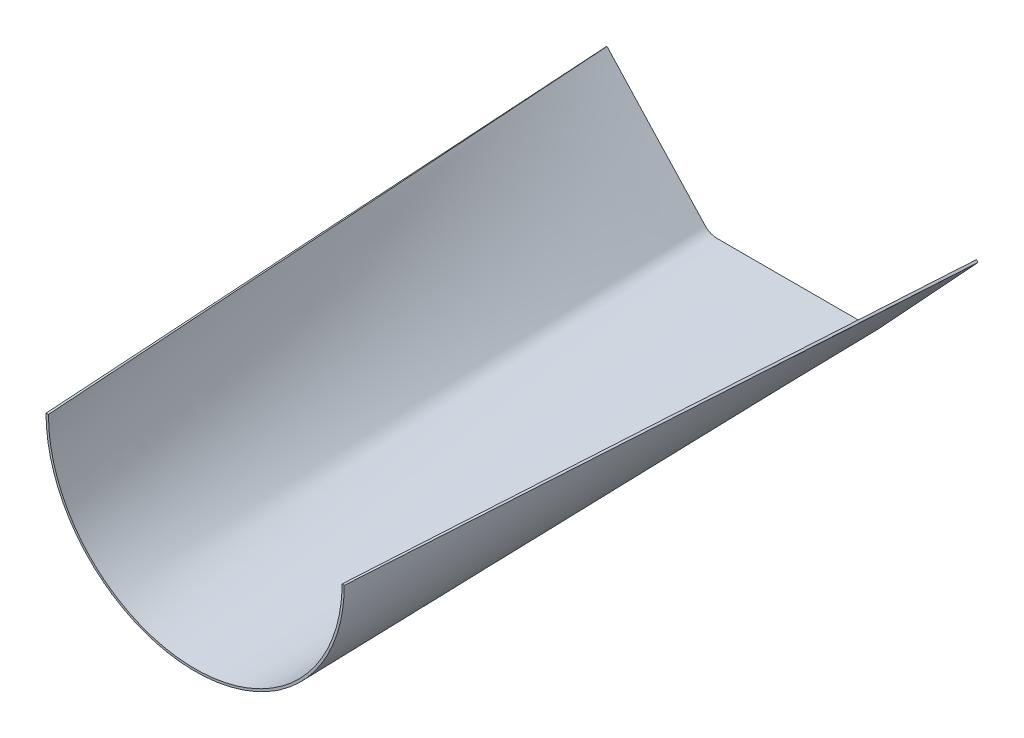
ISO-10303-21;
HEADER;
FILE_DESCRIPTION(('STEP AP214'),'2;1');
FILE_NAME('part.step','',(''),(''),'','','');
FILE_SCHEMA(('AUTOMOTIVE_DESIGN { 1 0 10303 214 1 1 1 1 }'));
ENDSEC;
DATA;
#1=APPLICATION_CONTEXT('core data for automotive mechanical design processes');
#2=APPLICATION_PROTOCOL_DEFINITION('international standard','automotive_design',2000,#1);
#3=PRODUCT_CONTEXT('',#1,'mechanical');
#4=PRODUCT('Part','Part','',(#3));
#5=PRODUCT_RELATED_PRODUCT_CATEGORY('part','',(#4));
#6=PRODUCT_DEFINITION_FORMATION('','',#4);
#7=PRODUCT_DEFINITION_CONTEXT('part definition',#1,'design');
#8=PRODUCT_DEFINITION('design','',#6,#7);
#9=PRODUCT_DEFINITION_SHAPE('','',#8);
#10=(LENGTH_UNIT() NAMED_UNIT(*) SI_UNIT(.MILLI.,.METRE.));
#11=(NAMED_UNIT(*) PLANE_ANGLE_UNIT() SI_UNIT($,.RADIAN.));
#12=(NAMED_UNIT(*) SI_UNIT($,.STERADIAN.) SOLID_ANGLE_UNIT());
#13=UNCERTAINTY_MEASURE_WITH_UNIT(LENGTH_MEASURE(1.E-05),#10,'distance_accuracy_value','');
#14=(GEOMETRIC_REPRESENTATION_CONTEXT(3) GLOBAL_UNCERTAINTY_ASSIGNED_CONTEXT((#13)) GLOBAL_UNIT_ASSIGNED_CONTEXT((#10,
#11,#12)) REPRESENTATION_CONTEXT('',''));
#15=CARTESIAN_POINT('',(0.,0.,0.));
#16=DIRECTION('',(0.,0.,1.));
#17=DIRECTION('',(1.,0.,0.));
#18=AXIS2_PLACEMENT_3D('',#15,#16,#17);
#19=CARTESIAN_POINT('',(100.015591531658,7.30268658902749E-13,406.300974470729));
#20=CARTESIAN_POINT('',(100.01474595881,-4.85608194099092,406.314503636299));
#21=CARTESIAN_POINT('',(99.6587670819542,-9.80085418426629,406.327686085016));
#22=CARTESIAN_POINT('',(98.1796948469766,-19.7080639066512,406.352584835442));
#23=CARTESIAN_POINT('',(97.0569755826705,-24.6695552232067,406.364304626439));
#24=CARTESIAN_POINT('',(94.0373522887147,-34.431861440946,406.385534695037));
#25=CARTESIAN_POINT('',(92.1405435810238,-39.2312774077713,406.395054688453));
#26=CARTESIAN_POINT('',(87.6221579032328,-48.4915337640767,406.411292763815));
#27=CARTESIAN_POINT('',(85.0001220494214,-52.9513738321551,406.418005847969));
#28=CARTESIAN_POINT('',(79.1323450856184,-61.375651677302,406.428267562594));
#29=CARTESIAN_POINT('',(75.8865044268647,-65.3404848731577,406.431787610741));
#30=CARTESIAN_POINT('',(68.9109706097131,-72.6591779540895,406.435486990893));
#31=CARTESIAN_POINT('',(65.1822198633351,-76.013586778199,406.435667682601));
#32=CARTESIAN_POINT('',(60.8060013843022,-79.4075270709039,406.434025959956));
#33=CARTESIAN_POINT('',(60.3172455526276,-79.7794012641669,406.433818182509));
#34=CARTESIAN_POINT('',(59.3350420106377,-80.5126076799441,406.433352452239));
#35=CARTESIAN_POINT('',(58.8411262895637,-80.8742500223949,406.433103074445));
#36=CARTESIAN_POINT('',(57.8508459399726,-81.5856443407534,406.432517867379));
#37=CARTESIAN_POINT('',(57.3615555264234,-81.9305428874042,406.432131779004));
#38=CARTESIAN_POINT('',(56.9408574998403,-82.2222841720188,406.43199267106));
#39=CARTESIAN_POINT('',(56.8682045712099,-82.2722237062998,406.432029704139));
#40=CARTESIAN_POINT('',(56.7361824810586,-82.3627280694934,406.431889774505));
#41=CARTESIAN_POINT('',(56.6808336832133,-82.4006658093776,406.431831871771));
#42=CARTESIAN_POINT('',(56.5403215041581,-82.4969593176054,406.431688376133));
#43=CARTESIAN_POINT('',(56.4806929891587,-82.5377948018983,406.431633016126));
#44=CARTESIAN_POINT('',(56.3952891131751,-82.5962204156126,406.43157556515));
#45=CARTESIAN_POINT('',(56.369586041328,-82.613762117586,406.431576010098));
#46=CARTESIAN_POINT('',(56.315716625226,-82.6504917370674,406.431545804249));
#47=CARTESIAN_POINT('',(56.2887725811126,-82.6688435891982,406.431531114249));
#48=CARTESIAN_POINT('',(56.2079125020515,-82.7238602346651,406.431488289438));
#49=CARTESIAN_POINT('',(56.1539685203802,-82.760486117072,406.431461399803));
#50=CARTESIAN_POINT('',(55.992025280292,-82.8702078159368,406.431385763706));
#51=CARTESIAN_POINT('',(55.8839147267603,-82.9431476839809,406.431342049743));
#52=CARTESIAN_POINT('',(55.3426265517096,-83.3068033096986,406.431157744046));
#53=CARTESIAN_POINT('',(54.9072426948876,-83.5943879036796,406.431119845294));
#54=CARTESIAN_POINT('',(52.71897718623,-85.0153523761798,406.43152775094));
#55=CARTESIAN_POINT('',(50.9320552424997,-86.0978535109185,406.43386360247));
#56=CARTESIAN_POINT('',(48.8869877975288,-87.2509112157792,406.438389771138));
#57=CARTESIAN_POINT('',(48.6592750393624,-87.3781293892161,406.438917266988));
#58=CARTESIAN_POINT('',(48.3740434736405,-87.5360199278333,406.439605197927));
#59=CARTESIAN_POINT('',(48.3169676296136,-87.5675414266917,406.439744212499));
#60=CARTESIAN_POINT('',(48.2313098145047,-87.614738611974,406.439954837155));
#61=CARTESIAN_POINT('',(48.2057587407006,-87.6288088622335,406.440027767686));
#62=CARTESIAN_POINT('',(48.1272403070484,-87.6719228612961,406.440232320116));
#63=CARTESIAN_POINT('',(48.0731670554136,-87.701571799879,406.440359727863));
#64=CARTESIAN_POINT('',(47.8976341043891,-87.7977211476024,406.440757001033));
#65=CARTESIAN_POINT('',(47.7732137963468,-87.8662963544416,406.440985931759));
#66=CARTESIAN_POINT('',(47.4399249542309,-88.047441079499,406.442029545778));
#67=CARTESIAN_POINT('',(47.2247250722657,-88.1629170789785,406.442587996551));
#68=CARTESIAN_POINT('',(46.7404773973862,-88.4199321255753,406.443810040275));
#69=CARTESIAN_POINT('',(46.4711488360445,-88.5616293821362,406.444467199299));
#70=CARTESIAN_POINT('',(45.9177459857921,-88.8497129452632,406.445822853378));
#71=CARTESIAN_POINT('',(45.6366200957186,-88.9944948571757,406.446518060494));
#72=CARTESIAN_POINT('',(40.8642739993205,-91.4229806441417,406.458111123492));
#73=CARTESIAN_POINT('',(36.1169215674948,-93.4094343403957,406.467585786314));
#74=CARTESIAN_POINT('',(26.2416793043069,-96.6502766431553,406.483019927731));
#75=CARTESIAN_POINT('',(21.1148815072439,-97.903682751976,406.48898490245));
#76=CARTESIAN_POINT('',(10.6584022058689,-99.5869519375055,406.496988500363));
#77=CARTESIAN_POINT('',(5.32909874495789,-100.015591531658,406.499025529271));
#78=CARTESIAN_POINT('',(-5.32909874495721,-100.015591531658,406.499025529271));
#79=CARTESIAN_POINT('',(-10.6584022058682,-99.5869519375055,406.496988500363));
#80=CARTESIAN_POINT('',(-21.1148815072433,-97.9036827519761,406.48898490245));
#81=CARTESIAN_POINT('',(-26.2416793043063,-96.6502766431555,406.48301992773));
#82=CARTESIAN_POINT('',(-36.1169215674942,-93.4094343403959,406.467585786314));
#83=CARTESIAN_POINT('',(-40.8642739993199,-91.422980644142,406.458111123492));
#84=CARTESIAN_POINT('',(-45.636620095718,-88.994494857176,406.446518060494));
#85=CARTESIAN_POINT('',(-45.9177459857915,-88.8497129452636,406.445822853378));
#86=CARTESIAN_POINT('',(-46.4711488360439,-88.5616293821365,406.444467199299));
#87=CARTESIAN_POINT('',(-46.7404773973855,-88.4199321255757,406.443810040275));
#88=CARTESIAN_POINT('',(-47.224725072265,-88.1629170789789,406.442587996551));
#89=CARTESIAN_POINT('',(-47.4399249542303,-88.0474410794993,406.442029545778));
#90=CARTESIAN_POINT('',(-47.7732137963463,-87.8662963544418,406.440985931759));
#91=CARTESIAN_POINT('',(-47.8976341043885,-87.7977211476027,406.440757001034));
#92=CARTESIAN_POINT('',(-48.073167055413,-87.7015717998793,406.440359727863));
#93=CARTESIAN_POINT('',(-48.1272403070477,-87.6719228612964,406.440232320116));
#94=CARTESIAN_POINT('',(-48.2057587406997,-87.628808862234,406.440027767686));
#95=CARTESIAN_POINT('',(-48.2313098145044,-87.6147386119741,406.439954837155));
#96=CARTESIAN_POINT('',(-48.3169676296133,-87.5675414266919,406.439744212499));
#97=CARTESIAN_POINT('',(-48.3740434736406,-87.5360199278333,406.439605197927));
#98=CARTESIAN_POINT('',(-48.6592750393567,-87.3781293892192,406.438917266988));
#99=CARTESIAN_POINT('',(-48.8869877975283,-87.2509112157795,406.438389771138));
#100=CARTESIAN_POINT('',(-50.9320552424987,-86.097853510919,406.43386360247));
#101=CARTESIAN_POINT('',(-52.7189771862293,-85.0153523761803,406.43152775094));
#102=CARTESIAN_POINT('',(-54.907242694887,-83.5943879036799,406.431119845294));
#103=CARTESIAN_POINT('',(-55.3426265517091,-83.3068033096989,406.431157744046));
#104=CARTESIAN_POINT('',(-55.8839147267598,-82.9431476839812,406.431342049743));
#105=CARTESIAN_POINT('',(-55.9920252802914,-82.8702078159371,406.431385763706));
#106=CARTESIAN_POINT('',(-56.1539685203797,-82.7604861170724,406.431461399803));
#107=CARTESIAN_POINT('',(-56.2079125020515,-82.7238602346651,406.431488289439));
#108=CARTESIAN_POINT('',(-56.2887725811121,-82.6688435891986,406.431531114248));
#109=CARTESIAN_POINT('',(-56.3157166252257,-82.6504917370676,406.43154580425));
#110=CARTESIAN_POINT('',(-56.3695860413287,-82.6137621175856,406.431576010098));
#111=CARTESIAN_POINT('',(-56.3952891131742,-82.5962204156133,406.43157556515));
#112=CARTESIAN_POINT('',(-56.480692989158,-82.5377948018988,406.431633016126));
#113=CARTESIAN_POINT('',(-56.5403215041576,-82.4969593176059,406.431688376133));
#114=CARTESIAN_POINT('',(-56.6808336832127,-82.400665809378,406.431831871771));
#115=CARTESIAN_POINT('',(-56.736182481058,-82.3627280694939,406.431889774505));
#116=CARTESIAN_POINT('',(-56.8682045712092,-82.2722237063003,406.432029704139));
#117=CARTESIAN_POINT('',(-56.9408574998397,-82.2222841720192,406.43199267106));
#118=CARTESIAN_POINT('',(-57.3615555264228,-81.9305428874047,406.432131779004));
#119=CARTESIAN_POINT('',(-57.8508459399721,-81.5856443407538,406.432517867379));
#120=CARTESIAN_POINT('',(-58.8411262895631,-80.8742500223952,406.433103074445));
#121=CARTESIAN_POINT('',(-59.3350420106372,-80.5126076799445,406.433352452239));
#122=CARTESIAN_POINT('',(-60.317245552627,-79.7794012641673,406.433818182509));
#123=CARTESIAN_POINT('',(-60.8060013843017,-79.4075270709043,406.434025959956));
#124=CARTESIAN_POINT('',(-65.1822198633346,-76.0135867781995,406.435667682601));
#125=CARTESIAN_POINT('',(-68.9109706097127,-72.6591779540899,406.435486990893));
#126=CARTESIAN_POINT('',(-75.8865044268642,-65.3404848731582,406.431787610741));
#127=CARTESIAN_POINT('',(-79.1323556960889,-61.3756364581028,406.428268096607));
#128=CARTESIAN_POINT('',(-85.00011143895,-52.9513890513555,406.418005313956));
#129=CARTESIAN_POINT('',(-87.6221579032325,-48.4915337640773,406.411292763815));
#130=CARTESIAN_POINT('',(-92.1405435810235,-39.2312774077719,406.395054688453));
#131=CARTESIAN_POINT('',(-94.0373522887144,-34.4318614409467,406.385534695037));
#132=CARTESIAN_POINT('',(-97.0569755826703,-24.6695552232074,406.364304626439));
#133=CARTESIAN_POINT('',(-98.1796948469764,-19.7080639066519,406.352584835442));
#134=CARTESIAN_POINT('',(-99.6587670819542,-9.80085418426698,406.327686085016));
#135=CARTESIAN_POINT('',(-100.01474595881,-4.85608194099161,406.314503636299));
#136=CARTESIAN_POINT('',(-100.015591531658,0.,406.300974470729));
#137=CARTESIAN_POINT('',(101.6,7.21911419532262E-13,406.4));
#138=CARTESIAN_POINT('',(101.6,-4.93293042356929,406.4));
#139=CARTESIAN_POINT('',(101.239024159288,-9.95633771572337,406.4));
#140=CARTESIAN_POINT('',(99.7374462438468,-20.0207606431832,406.4));
#141=CARTESIAN_POINT('',(98.5971626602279,-25.0611797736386,406.4));
#142=CARTESIAN_POINT('',(95.5300293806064,-34.9782368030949,406.4));
#143=CARTESIAN_POINT('',(93.6031192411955,-39.8539740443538,406.4));
#144=CARTESIAN_POINT('',(89.0130177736,-49.2611339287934,406.4));
#145=CARTESIAN_POINT('',(86.3494171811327,-53.7915803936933,406.4));
#146=CARTESIAN_POINT('',(80.3880461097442,-62.3499640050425,406.4));
#147=CARTESIAN_POINT('',(77.0907425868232,-66.3774951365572,406.4));
#148=CARTESIAN_POINT('',(70.004498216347,-73.8122297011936,406.4));
#149=CARTESIAN_POINT('',(66.2165016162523,-77.2199166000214,406.4));
#150=CARTESIAN_POINT('',(61.7709633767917,-80.6676627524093,406.4));
#151=CARTESIAN_POINT('',(61.2744660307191,-81.045432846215,406.4));
#152=CARTESIAN_POINT('',(60.2766987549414,-81.790269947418,406.4));
#153=CARTESIAN_POINT('',(59.7746130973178,-82.1578962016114,406.4));
#154=CARTESIAN_POINT('',(58.7693986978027,-82.8800339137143,406.4));
#155=CARTESIAN_POINT('',(58.2756508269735,-83.2281140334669,406.4));
#156=CARTESIAN_POINT('',(57.8429190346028,-83.5282038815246,406.4));
#157=CARTESIAN_POINT('',(57.7656991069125,-83.5812821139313,406.4));
#158=CARTESIAN_POINT('',(57.6335844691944,-83.6718533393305,406.4));
#159=CARTESIAN_POINT('',(57.5781750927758,-83.7098340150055,406.4));
#160=CARTESIAN_POINT('',(57.4373967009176,-83.8063134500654,406.4));
#161=CARTESIAN_POINT('',(57.3774774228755,-83.8473496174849,406.4));
#162=CARTESIAN_POINT('',(57.2908696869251,-83.9066002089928,406.4));
#163=CARTESIAN_POINT('',(57.2641546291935,-83.9248328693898,406.4));
#164=CARTESIAN_POINT('',(57.2094288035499,-83.9621471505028,406.4));
#165=CARTESIAN_POINT('',(57.1820564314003,-83.9807910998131,406.4));
#166=CARTESIAN_POINT('',(57.0999109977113,-84.0366833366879,406.4));
#167=CARTESIAN_POINT('',(57.0451096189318,-84.0738920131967,406.4));
#168=CARTESIAN_POINT('',(56.8805926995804,-84.1853592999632,406.4));
#169=CARTESIAN_POINT('',(56.7707643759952,-84.2594591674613,406.4));
#170=CARTESIAN_POINT('',(56.2208773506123,-84.6288962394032,406.4));
#171=CARTESIAN_POINT('',(55.778582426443,-84.9210466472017,406.4));
#172=CARTESIAN_POINT('',(53.5555959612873,-86.3645476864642,406.4));
#173=CARTESIAN_POINT('',(51.7403688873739,-87.4641453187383,406.4));
#174=CARTESIAN_POINT('',(49.6627671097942,-88.6354206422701,406.4));
#175=CARTESIAN_POINT('',(49.4314298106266,-88.7646488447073,406.4));
#176=CARTESIAN_POINT('',(49.1416553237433,-88.9250342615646,406.4));
#177=CARTESIAN_POINT('',(49.0836702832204,-88.9570538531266,406.4));
#178=CARTESIAN_POINT('',(48.9966477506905,-89.0049968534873,406.4));
#179=CARTESIAN_POINT('',(48.9702719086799,-89.0195188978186,406.4));
#180=CARTESIAN_POINT('',(48.8902339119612,-89.0634612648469,406.4));
#181=CARTESIAN_POINT('',(48.8357383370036,-89.0933377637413,406.4));
#182=CARTESIAN_POINT('',(48.6597174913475,-89.189742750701,406.4));
#183=CARTESIAN_POINT('',(48.5372664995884,-89.257249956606,406.4));
#184=CARTESIAN_POINT('',(48.1913193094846,-89.4452423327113,406.4));
#185=CARTESIAN_POINT('',(47.9723636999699,-89.5627018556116,406.4));
#186=CARTESIAN_POINT('',(47.4805942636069,-89.8236708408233,406.4));
#187=CARTESIAN_POINT('',(47.2077804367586,-89.9671803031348,406.4));
#188=CARTESIAN_POINT('',(46.6464003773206,-90.2593724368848,406.4));
#189=CARTESIAN_POINT('',(46.3606414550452,-90.4065185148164,406.4));
#190=CARTESIAN_POINT('',(41.5124520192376,-92.8732053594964,406.4));
#191=CARTESIAN_POINT('',(36.6895254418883,-94.8908312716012,406.4));
#192=CARTESIAN_POINT('',(26.6577653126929,-98.1822557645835,406.4));
#193=CARTESIAN_POINT('',(21.44952592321,-99.45523077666,406.4));
#194=CARTESIAN_POINT('',(10.8273631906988,-101.164688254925,406.4));
#195=CARTESIAN_POINT('',(5.41386667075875,-101.6,406.4));
#196=CARTESIAN_POINT('',(-5.41386667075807,-101.6,406.4));
#197=CARTESIAN_POINT('',(-10.8273631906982,-101.164688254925,406.4));
#198=CARTESIAN_POINT('',(-21.4495259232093,-99.4552307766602,406.4));
#199=CARTESIAN_POINT('',(-26.6577653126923,-98.1822557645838,406.4));
#200=CARTESIAN_POINT('',(-36.6895254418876,-94.8908312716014,406.4));
#201=CARTESIAN_POINT('',(-41.512452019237,-92.8732053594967,406.4));
#202=CARTESIAN_POINT('',(-46.3606414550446,-90.4065185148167,406.4));
#203=CARTESIAN_POINT('',(-46.64640037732,-90.2593724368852,406.4));
#204=CARTESIAN_POINT('',(-47.207780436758,-89.9671803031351,406.4));
#205=CARTESIAN_POINT('',(-47.4805942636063,-89.8236708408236,406.4));
#206=CARTESIAN_POINT('',(-47.9723636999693,-89.5627018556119,406.4));
#207=CARTESIAN_POINT('',(-48.191319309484,-89.4452423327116,406.4));
#208=CARTESIAN_POINT('',(-48.5372664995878,-89.2572499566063,406.4));
#209=CARTESIAN_POINT('',(-48.6597174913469,-89.1897427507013,406.4));
#210=CARTESIAN_POINT('',(-48.835738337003,-89.0933377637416,406.4));
#211=CARTESIAN_POINT('',(-48.8902339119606,-89.0634612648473,406.4));
#212=CARTESIAN_POINT('',(-48.9702719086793,-89.019518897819,406.4));
#213=CARTESIAN_POINT('',(-48.9966477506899,-89.0049968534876,406.4));
#214=CARTESIAN_POINT('',(-49.0836702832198,-88.9570538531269,406.4));
#215=CARTESIAN_POINT('',(-49.1416553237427,-88.9250342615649,406.4));
#216=CARTESIAN_POINT('',(-49.431429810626,-88.7646488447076,406.4));
#217=CARTESIAN_POINT('',(-49.6627671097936,-88.6354206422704,406.4));
#218=CARTESIAN_POINT('',(-51.7403688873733,-87.4641453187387,406.4));
#219=CARTESIAN_POINT('',(-53.5555959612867,-86.3645476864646,406.4));
#220=CARTESIAN_POINT('',(-55.7785824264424,-84.9210466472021,406.4));
#221=CARTESIAN_POINT('',(-56.2208773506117,-84.6288962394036,406.4));
#222=CARTESIAN_POINT('',(-56.7707643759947,-84.2594591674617,406.4));
#223=CARTESIAN_POINT('',(-56.8805926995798,-84.1853592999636,406.4));
#224=CARTESIAN_POINT('',(-57.0451096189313,-84.0738920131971,406.4));
#225=CARTESIAN_POINT('',(-57.0999109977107,-84.0366833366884,406.4));
#226=CARTESIAN_POINT('',(-57.1820564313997,-83.9807910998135,406.4));
#227=CARTESIAN_POINT('',(-57.2094288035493,-83.9621471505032,406.4));
#228=CARTESIAN_POINT('',(-57.2641546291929,-83.9248328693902,406.4));
#229=CARTESIAN_POINT('',(-57.2908696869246,-83.9066002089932,406.4));
#230=CARTESIAN_POINT('',(-57.3774774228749,-83.8473496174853,406.4));
#231=CARTESIAN_POINT('',(-57.437396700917,-83.8063134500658,406.4));
#232=CARTESIAN_POINT('',(-57.5781750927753,-83.709834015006,406.4));
#233=CARTESIAN_POINT('',(-57.6335844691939,-83.6718533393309,406.4));
#234=CARTESIAN_POINT('',(-57.7656991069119,-83.5812821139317,406.4));
#235=CARTESIAN_POINT('',(-57.8429190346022,-83.528203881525,406.4));
#236=CARTESIAN_POINT('',(-58.275650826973,-83.2281140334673,406.4));
#237=CARTESIAN_POINT('',(-58.7693986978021,-82.8800339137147,406.4));
#238=CARTESIAN_POINT('',(-59.7746130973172,-82.1578962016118,406.4));
#239=CARTESIAN_POINT('',(-60.2766987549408,-81.7902699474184,406.4));
#240=CARTESIAN_POINT('',(-61.2744660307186,-81.0454328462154,406.4));
#241=CARTESIAN_POINT('',(-61.7709633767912,-80.6676627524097,406.4));
#242=CARTESIAN_POINT('',(-66.2165016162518,-77.2199166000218,406.4));
#243=CARTESIAN_POINT('',(-70.0044982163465,-73.812229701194,406.4));
#244=CARTESIAN_POINT('',(-77.0907425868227,-66.3774951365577,406.4));
#245=CARTESIAN_POINT('',(-80.3880461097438,-62.349964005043,406.4));
#246=CARTESIAN_POINT('',(-86.3494171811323,-53.7915803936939,406.4));
#247=CARTESIAN_POINT('',(-89.0130177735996,-49.261133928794,406.4));
#248=CARTESIAN_POINT('',(-93.6031192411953,-39.8539740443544,406.4));
#249=CARTESIAN_POINT('',(-95.5300293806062,-34.9782368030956,406.4));
#250=CARTESIAN_POINT('',(-98.5971626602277,-25.0611797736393,406.4));
#251=CARTESIAN_POINT('',(-99.7374462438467,-20.0207606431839,406.4));
#252=CARTESIAN_POINT('',(-101.239024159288,-9.95633771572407,406.4));
#253=CARTESIAN_POINT('',(-101.6,-4.93293042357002,406.4));
#254=CARTESIAN_POINT('',(-101.6,0.,406.4));
#255=B_SPLINE_SURFACE_WITH_KNOTS('',1,3,((#19,#20,#21,#22,#23,#24,#25,#26,#27,#28,#29,#30,#31,
#32,#33,#34,#35,#36,#37,#38,#39,#40,#41,#42,#43,#44,#45,#46,#47,#48,#49,#50,#51,#52,#53,#54,#55,
#56,#57,#58,#59,#60,#61,#62,#63,#64,#65,#66,#67,#68,#69,#70,#71,#72,#73,#74,#75,#76,#77,#78,#79,
#80,#81,#82,#83,#84,#85,#86,#87,#88,#89,#90,#91,#92,#93,#94,#95,#96,#97,#98,#99,#100,#101,#102,
#103,#104,#105,#106,#107,#108,#109,#110,#111,#112,#113,#114,#115,#116,#117,#118,#119,#120,#121,
#122,#123,#124,#125,#126,#127,#128,#129,#130,#131,#132,#133,#134,#135,#136),(#137,#138,#139,
#140,#141,#142,#143,#144,#145,#146,#147,#148,#149,#150,#151,#152,#153,#154,#155,#156,#157,#158,
#159,#160,#161,#162,#163,#164,#165,#166,#167,#168,#169,#170,#171,#172,#173,#174,#175,#176,#177,
#178,#179,#180,#181,#182,#183,#184,#185,#186,#187,#188,#189,#190,#191,#192,#193,#194,#195,#196,
#197,#198,#199,#200,#201,#202,#203,#204,#205,#206,#207,#208,#209,#210,#211,#212,#213,#214,#215,
#216,#217,#218,#219,#220,#221,#222,#223,#224,#225,#226,#227,#228,#229,#230,#231,#232,#233,#234,
#235,#236,#237,#238,#239,#240,#241,#242,#243,#244,#245,#246,#247,#248,#249,#250,#251,#252,#253,
#254)),.UNSPECIFIED.,.F.,.F.,.F.,(2,2),(4,2,2,2,2,2,2,2,2,2,2,2,2,2,2,2,2,2,2,2,2,2,2,2,2,2,2,2,
2,2,2,2,2,2,2,2,2,2,2,2,2,2,2,2,2,2,2,2,2,2,2,2,2,2,2,2,2,2,4),(0.,1.),(0.,0.03125,0.0625,
0.09375,0.125,0.15625,0.1875,0.19140625,0.1953125,0.19921875,0.2001953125,0.201171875,0.203125,
0.205078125,0.20703125,0.2109375,0.21875,0.25,0.375,0.390625,0.39453125,0.396484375,0.3984375,
0.400390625,0.40234375,0.404296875,0.40625,0.4375,0.46875,0.5,0.53125,0.5625,0.59375,
0.595703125,0.59765625,0.599609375,0.6015625,0.603515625,0.60546875,0.609375,0.625,0.75,0.78125,
0.7890625,0.79296875,0.794921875,0.796875,0.798828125,0.7998046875,0.80078125,0.8046875,
0.80859375,0.8125,0.84375,0.875,0.90625,0.9375,0.96875,1.),.UNSPECIFIED.);
#256=CARTESIAN_POINT('',(-101.6,0.,406.4));
#257=CARTESIAN_POINT('',(-100.015591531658,0.,406.300974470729));
#258=B_SPLINE_CURVE_WITH_KNOTS('',1,(#256,#257),.UNSPECIFIED.,.F.,.F.,(2,2),(0.,1.),.UNSPECIFIED.);
#259=CARTESIAN_POINT('',(-101.6,0.,406.4));
#260=VERTEX_POINT('',#259);
#261=CARTESIAN_POINT('',(-100.015591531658,0.,406.300974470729));
#262=VERTEX_POINT('',#261);
#263=EDGE_CURVE('E14',#260,#262,#258,.T.);
#264=CARTESIAN_POINT('',(-101.6,0.,406.4));
#265=CARTESIAN_POINT('',(-101.6,-4.93293042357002,406.4));
#266=CARTESIAN_POINT('',(-101.239024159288,-9.95633771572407,406.4));
#267=CARTESIAN_POINT('',(-99.7374462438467,-20.0207606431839,406.4));
#268=CARTESIAN_POINT('',(-98.5971626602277,-25.0611797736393,406.4));
#269=CARTESIAN_POINT('',(-95.5300293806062,-34.9782368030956,406.4));
#270=CARTESIAN_POINT('',(-93.6031192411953,-39.8539740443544,406.4));
#271=CARTESIAN_POINT('',(-89.0130177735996,-49.261133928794,406.4));
#272=CARTESIAN_POINT('',(-86.3494171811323,-53.7915803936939,406.4));
#273=CARTESIAN_POINT('',(-80.3880461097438,-62.349964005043,406.4));
#274=CARTESIAN_POINT('',(-77.0907425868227,-66.3774951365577,406.4));
#275=CARTESIAN_POINT('',(-70.0044982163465,-73.812229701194,406.4));
#276=CARTESIAN_POINT('',(-66.2165016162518,-77.2199166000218,406.4));
#277=CARTESIAN_POINT('',(-61.7709633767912,-80.6676627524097,406.4));
#278=CARTESIAN_POINT('',(-61.2744660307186,-81.0454328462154,406.4));
#279=CARTESIAN_POINT('',(-60.2766987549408,-81.7902699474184,406.4));
#280=CARTESIAN_POINT('',(-59.7746130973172,-82.1578962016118,406.4));
#281=CARTESIAN_POINT('',(-58.7693986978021,-82.8800339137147,406.4));
#282=CARTESIAN_POINT('',(-58.275650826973,-83.2281140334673,406.4));
#283=CARTESIAN_POINT('',(-57.8429190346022,-83.528203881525,406.4));
#284=CARTESIAN_POINT('',(-57.7656991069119,-83.5812821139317,406.4));
#285=CARTESIAN_POINT('',(-57.6335844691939,-83.6718533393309,406.4));
#286=CARTESIAN_POINT('',(-57.5781750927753,-83.709834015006,406.4));
#287=CARTESIAN_POINT('',(-57.437396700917,-83.8063134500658,406.4));
#288=CARTESIAN_POINT('',(-57.3774774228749,-83.8473496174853,406.4));
#289=CARTESIAN_POINT('',(-57.2908696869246,-83.9066002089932,406.4));
#290=CARTESIAN_POINT('',(-57.2641546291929,-83.9248328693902,406.4));
#291=CARTESIAN_POINT('',(-57.2094288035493,-83.9621471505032,406.4));
#292=CARTESIAN_POINT('',(-57.1820564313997,-83.9807910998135,406.4));
#293=CARTESIAN_POINT('',(-57.0999109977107,-84.0366833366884,406.4));
#294=CARTESIAN_POINT('',(-57.0451096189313,-84.0738920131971,406.4));
#295=CARTESIAN_POINT('',(-56.8805926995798,-84.1853592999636,406.4));
#296=CARTESIAN_POINT('',(-56.7707643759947,-84.2594591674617,406.4));
#297=CARTESIAN_POINT('',(-56.2208773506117,-84.6288962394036,406.4));
#298=CARTESIAN_POINT('',(-55.7785824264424,-84.9210466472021,406.4));
#299=CARTESIAN_POINT('',(-53.5555959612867,-86.3645476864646,406.4));
#300=CARTESIAN_POINT('',(-51.7403688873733,-87.4641453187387,406.4));
#301=CARTESIAN_POINT('',(-49.6627671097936,-88.6354206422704,406.4));
#302=CARTESIAN_POINT('',(-49.431429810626,-88.7646488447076,406.4));
#303=CARTESIAN_POINT('',(-49.1416553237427,-88.9250342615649,406.4));
#304=CARTESIAN_POINT('',(-49.0836702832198,-88.9570538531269,406.4));
#305=CARTESIAN_POINT('',(-48.9966477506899,-89.0049968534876,406.4));
#306=CARTESIAN_POINT('',(-48.9702719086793,-89.019518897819,406.4));
#307=CARTESIAN_POINT('',(-48.8902339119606,-89.0634612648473,406.4));
#308=CARTESIAN_POINT('',(-48.835738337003,-89.0933377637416,406.4));
#309=CARTESIAN_POINT('',(-48.6597174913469,-89.1897427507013,406.4));
#310=CARTESIAN_POINT('',(-48.5372664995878,-89.2572499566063,406.4));
#311=CARTESIAN_POINT('',(-48.191319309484,-89.4452423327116,406.4));
#312=CARTESIAN_POINT('',(-47.9723636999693,-89.5627018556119,406.4));
#313=CARTESIAN_POINT('',(-47.4805942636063,-89.8236708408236,406.4));
#314=CARTESIAN_POINT('',(-47.207780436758,-89.9671803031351,406.4));
#315=CARTESIAN_POINT('',(-46.64640037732,-90.2593724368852,406.4));
#316=CARTESIAN_POINT('',(-46.3606414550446,-90.4065185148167,406.4));
#317=CARTESIAN_POINT('',(-41.512452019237,-92.8732053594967,406.4));
#318=CARTESIAN_POINT('',(-36.6895254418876,-94.8908312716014,406.4));
#319=CARTESIAN_POINT('',(-26.6577653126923,-98.1822557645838,406.4));
#320=CARTESIAN_POINT('',(-21.4495259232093,-99.4552307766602,406.4));
#321=CARTESIAN_POINT('',(-10.8273631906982,-101.164688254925,406.4));
#322=CARTESIAN_POINT('',(-5.41386667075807,-101.6,406.4));
#323=CARTESIAN_POINT('',(5.41386667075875,-101.6,406.4));
#324=CARTESIAN_POINT('',(10.8273631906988,-101.164688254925,406.4));
#325=CARTESIAN_POINT('',(21.44952592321,-99.45523077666,406.4));
#326=CARTESIAN_POINT('',(26.6577653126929,-98.1822557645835,406.4));
#327=CARTESIAN_POINT('',(36.6895254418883,-94.8908312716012,406.4));
#328=CARTESIAN_POINT('',(41.5124520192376,-92.8732053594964,406.4));
#329=CARTESIAN_POINT('',(46.3606414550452,-90.4065185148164,406.4));
#330=CARTESIAN_POINT('',(46.6464003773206,-90.2593724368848,406.4));
#331=CARTESIAN_POINT('',(47.2077804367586,-89.9671803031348,406.4));
#332=CARTESIAN_POINT('',(47.4805942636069,-89.8236708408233,406.4));
#333=CARTESIAN_POINT('',(47.9723636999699,-89.5627018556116,406.4));
#334=CARTESIAN_POINT('',(48.1913193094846,-89.4452423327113,406.4));
#335=CARTESIAN_POINT('',(48.5372664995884,-89.257249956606,406.4));
#336=CARTESIAN_POINT('',(48.6597174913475,-89.189742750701,406.4));
#337=CARTESIAN_POINT('',(48.8357383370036,-89.0933377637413,406.4));
#338=CARTESIAN_POINT('',(48.8902339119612,-89.0634612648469,406.4));
#339=CARTESIAN_POINT('',(48.9702719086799,-89.0195188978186,406.4));
#340=CARTESIAN_POINT('',(48.9966477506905,-89.0049968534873,406.4));
#341=CARTESIAN_POINT('',(49.0836702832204,-88.9570538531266,406.4));
#342=CARTESIAN_POINT('',(49.1416553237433,-88.9250342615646,406.4));
#343=CARTESIAN_POINT('',(49.4314298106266,-88.7646488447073,406.4));
#344=CARTESIAN_POINT('',(49.6627671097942,-88.6354206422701,406.4));
#345=CARTESIAN_POINT('',(51.7403688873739,-87.4641453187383,406.4));
#346=CARTESIAN_POINT('',(53.5555959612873,-86.3645476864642,406.4));
#347=CARTESIAN_POINT('',(55.778582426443,-84.9210466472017,406.4));
#348=CARTESIAN_POINT('',(56.2208773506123,-84.6288962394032,406.4));
#349=CARTESIAN_POINT('',(56.7707643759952,-84.2594591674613,406.4));
#350=CARTESIAN_POINT('',(56.8805926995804,-84.1853592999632,406.4));
#351=CARTESIAN_POINT('',(57.0451096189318,-84.0738920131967,406.4));
#352=CARTESIAN_POINT('',(57.0999109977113,-84.0366833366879,406.4));
#353=CARTESIAN_POINT('',(57.1820564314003,-83.9807910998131,406.4));
#354=CARTESIAN_POINT('',(57.2094288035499,-83.9621471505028,406.4));
#355=CARTESIAN_POINT('',(57.2641546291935,-83.9248328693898,406.4));
#356=CARTESIAN_POINT('',(57.2908696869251,-83.9066002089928,406.4));
#357=CARTESIAN_POINT('',(57.3774774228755,-83.8473496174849,406.4));
#358=CARTESIAN_POINT('',(57.4373967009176,-83.8063134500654,406.4));
#359=CARTESIAN_POINT('',(57.5781750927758,-83.7098340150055,406.4));
#360=CARTESIAN_POINT('',(57.6335844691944,-83.6718533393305,406.4));
#361=CARTESIAN_POINT('',(57.7656991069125,-83.5812821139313,406.4));
#362=CARTESIAN_POINT('',(57.8429190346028,-83.5282038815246,406.4));
#363=CARTESIAN_POINT('',(58.2756508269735,-83.2281140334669,406.4));
#364=CARTESIAN_POINT('',(58.7693986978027,-82.8800339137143,406.4));
#365=CARTESIAN_POINT('',(59.7746130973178,-82.1578962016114,406.4));
#366=CARTESIAN_POINT('',(60.2766987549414,-81.790269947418,406.4));
#367=CARTESIAN_POINT('',(61.2744660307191,-81.045432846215,406.4));
#368=CARTESIAN_POINT('',(61.7709633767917,-80.6676627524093,406.4));
#369=CARTESIAN_POINT('',(66.2165016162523,-77.2199166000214,406.4));
#370=CARTESIAN_POINT('',(70.004498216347,-73.8122297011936,406.4));
#371=CARTESIAN_POINT('',(77.0907425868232,-66.3774951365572,406.4));
#372=CARTESIAN_POINT('',(80.3880461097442,-62.3499640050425,406.4));
#373=CARTESIAN_POINT('',(86.3494171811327,-53.7915803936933,406.4));
#374=CARTESIAN_POINT('',(89.0130177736,-49.2611339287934,406.4));
#375=CARTESIAN_POINT('',(93.6031192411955,-39.8539740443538,406.4));
#376=CARTESIAN_POINT('',(95.5300293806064,-34.9782368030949,406.4));
#377=CARTESIAN_POINT('',(98.5971626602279,-25.0611797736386,406.4));
#378=CARTESIAN_POINT('',(99.7374462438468,-20.0207606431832,406.4));
#379=CARTESIAN_POINT('',(101.239024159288,-9.95633771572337,406.4));
#380=CARTESIAN_POINT('',(101.6,-4.93293042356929,406.4));
#381=CARTESIAN_POINT('',(101.6,7.21911419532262E-13,406.4));
#382=B_SPLINE_CURVE_WITH_KNOTS('',3,(#264,#265,#266,#267,#268,#269,#270,#271,#272,#273,#274,
#275,#276,#277,#278,#279,#280,#281,#282,#283,#284,#285,#286,#287,#288,#289,#290,#291,#292,#293,
#294,#295,#296,#297,#298,#299,#300,#301,#302,#303,#304,#305,#306,#307,#308,#309,#310,#311,#312,
#313,#314,#315,#316,#317,#318,#319,#320,#321,#322,#323,#324,#325,#326,#327,#328,#329,#330,#331,
#332,#333,#334,#335,#336,#337,#338,#339,#340,#341,#342,#343,#344,#345,#346,#347,#348,#349,#350,
#351,#352,#353,#354,#355,#356,#357,#358,#359,#360,#361,#362,#363,#364,#365,#366,#367,#368,#369,
#370,#371,#372,#373,#374,#375,#376,#377,#378,#379,#380,#381),.UNSPECIFIED.,.F.,.F.,(4,2,2,2,2,2,
2,2,2,2,2,2,2,2,2,2,2,2,2,2,2,2,2,2,2,2,2,2,2,2,2,2,2,2,2,2,2,2,2,2,2,2,2,2,2,2,2,2,2,2,2,2,2,2,
2,2,2,2,4),(0.,0.03125,0.0625,0.09375,0.125,0.15625,0.1875,0.19140625,0.1953125,0.19921875,
0.2001953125,0.201171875,0.203125,0.205078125,0.20703125,0.2109375,0.21875,0.25,0.375,0.390625,
0.39453125,0.396484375,0.3984375,0.400390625,0.40234375,0.404296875,0.40625,0.4375,0.46875,0.5,
0.53125,0.5625,0.59375,0.595703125,0.59765625,0.599609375,0.6015625,0.603515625,0.60546875,
0.609375,0.625,0.75,0.78125,0.7890625,0.79296875,0.794921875,0.796875,0.798828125,0.7998046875,
0.80078125,0.8046875,0.80859375,0.8125,0.84375,0.875,0.90625,0.9375,0.96875,1.),.UNSPECIFIED.);
#383=CARTESIAN_POINT('',(101.6,7.21911419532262E-13,406.4));
#384=VERTEX_POINT('',#383);
#385=EDGE_CURVE('E557',#260,#384,#382,.T.);
#386=CARTESIAN_POINT('',(101.6,7.21911419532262E-13,406.4));
#387=CARTESIAN_POINT('',(100.015591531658,7.30268658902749E-13,406.300974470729));
#388=B_SPLINE_CURVE_WITH_KNOTS('',1,(#386,#387),.UNSPECIFIED.,.F.,.F.,(2,2),(0.,1.),.UNSPECIFIED.);
#389=CARTESIAN_POINT('',(100.015591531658,7.30268658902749E-13,406.300974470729));
#390=VERTEX_POINT('',#389);
#391=EDGE_CURVE('E506',#384,#390,#388,.T.);
#392=CARTESIAN_POINT('',(-100.015591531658,-2.31915957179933E-11,406.300974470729));
#393=CARTESIAN_POINT('',(-100.015362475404,-1.21942056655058,406.30437191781));
#394=CARTESIAN_POINT('',(-99.9928096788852,-2.4388335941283,406.307731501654));
#395=CARTESIAN_POINT('',(-99.9028111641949,-4.88628510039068,406.314395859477));
#396=CARTESIAN_POINT('',(-99.8349890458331,-6.11430975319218,406.317699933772));
#397=CARTESIAN_POINT('',(-99.6535155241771,-8.57647927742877,406.32424182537));
#398=CARTESIAN_POINT('',(-99.5395152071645,-9.81059845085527,406.327478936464));
#399=CARTESIAN_POINT('',(-99.2646670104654,-12.2824714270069,406.333875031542));
#400=CARTESIAN_POINT('',(-99.1034926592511,-13.5201889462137,406.337033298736));
#401=CARTESIAN_POINT('',(-98.733781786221,-15.9966834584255,406.343257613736));
#402=CARTESIAN_POINT('',(-98.524946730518,-17.23541587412,406.346322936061));
#403=CARTESIAN_POINT('',(-98.0595818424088,-19.7111619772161,406.35235173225));
#404=CARTESIAN_POINT('',(-97.8027883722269,-20.9481261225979,406.355314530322));
#405=CARTESIAN_POINT('',(-97.2410617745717,-23.4175520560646,406.361127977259));
#406=CARTESIAN_POINT('',(-96.9358954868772,-24.6499608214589,406.363977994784));
#407=CARTESIAN_POINT('',(-96.2774166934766,-27.1075795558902,406.369549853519));
#408=CARTESIAN_POINT('',(-95.9239010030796,-28.3327350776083,406.372271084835));
#409=CARTESIAN_POINT('',(-95.1690930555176,-30.7729937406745,406.377577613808));
#410=CARTESIAN_POINT('',(-94.767636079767,-31.9880459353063,406.38016239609));
#411=CARTESIAN_POINT('',(-93.9171863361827,-34.4051954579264,406.385188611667));
#412=CARTESIAN_POINT('',(-93.4680646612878,-35.6072474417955,406.387629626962));
#413=CARTESIAN_POINT('',(-92.5228088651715,-37.9956914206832,406.392352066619));
#414=CARTESIAN_POINT('',(-92.026576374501,-39.1820444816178,406.394633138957));
#415=CARTESIAN_POINT('',(-90.9881656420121,-41.5363837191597,406.399029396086));
#416=CARTESIAN_POINT('',(-90.4459262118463,-42.704342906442,406.401144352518));
#417=CARTESIAN_POINT('',(-89.3164681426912,-45.019097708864,406.405204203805));
#418=CARTESIAN_POINT('',(-88.7292251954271,-46.1658814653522,406.407149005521));
#419=CARTESIAN_POINT('',(-87.5108238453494,-48.4356940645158,406.410854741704));
#420=CARTESIAN_POINT('',(-86.8796708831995,-49.5587258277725,406.412615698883));
#421=CARTESIAN_POINT('',(-85.5751183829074,-51.7786728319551,406.415948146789));
#422=CARTESIAN_POINT('',(-84.9017557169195,-52.8756097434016,406.41751979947));
#423=CARTESIAN_POINT('',(-83.5144211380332,-55.0409047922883,406.420472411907));
#424=CARTESIAN_POINT('',(-82.8005192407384,-56.1093077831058,406.421853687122));
#425=CARTESIAN_POINT('',(-81.3337013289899,-58.215200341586,406.424416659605));
#426=CARTESIAN_POINT('',(-80.5808825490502,-59.2527576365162,406.425598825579));
#427=CARTESIAN_POINT('',(-79.038340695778,-61.2950785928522,406.4277580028));
#428=CARTESIAN_POINT('',(-78.248737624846,-62.2999329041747,406.428735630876));
#429=CARTESIAN_POINT('',(-76.6347958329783,-64.2749058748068,406.43048724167));
#430=CARTESIAN_POINT('',(-75.8106025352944,-65.2451433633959,406.43126199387));
#431=CARTESIAN_POINT('',(-74.1295484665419,-67.1489692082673,406.432604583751));
#432=CARTESIAN_POINT('',(-73.2728552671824,-68.0827055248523,406.433173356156));
#433=CARTESIAN_POINT('',(-71.5291728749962,-69.9121801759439,406.434098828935));
#434=CARTESIAN_POINT('',(-70.6423647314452,-70.8080911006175,406.434456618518));
#435=CARTESIAN_POINT('',(-68.8409580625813,-72.5606134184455,406.434964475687));
#436=CARTESIAN_POINT('',(-67.9265559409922,-73.4174266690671,406.435115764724));
#437=CARTESIAN_POINT('',(-66.0723764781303,-75.0903987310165,406.435210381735));
#438=CARTESIAN_POINT('',(-65.132809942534,-75.9067912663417,406.435155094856));
#439=CARTESIAN_POINT('',(-63.2307498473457,-77.4981205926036,406.434838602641));
#440=CARTESIAN_POINT('',(-62.2684726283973,-78.2733156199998,406.434578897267));
#441=CARTESIAN_POINT('',(-60.8069750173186,-79.4067739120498,406.43402418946));
#442=CARTESIAN_POINT('',(-60.3182557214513,-79.778655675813,406.43381262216));
#443=CARTESIAN_POINT('',(-59.3360794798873,-80.5118247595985,406.433358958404));
#444=CARTESIAN_POINT('',(-58.8426507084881,-80.8731497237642,406.433116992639));
#445=CARTESIAN_POINT('',(-58.1067618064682,-81.4018028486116,406.43266283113));
#446=CARTESIAN_POINT('',(-57.8667867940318,-81.5726081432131,406.432500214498));
#447=CARTESIAN_POINT('',(-57.4264344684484,-81.8839208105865,406.432231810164));
#448=CARTESIAN_POINT('',(-57.2262261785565,-82.0246654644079,406.432121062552));
#449=CARTESIAN_POINT('',(-56.8949415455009,-82.2539472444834,406.431955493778));
#450=CARTESIAN_POINT('',(-56.7644595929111,-82.3433427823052,406.431894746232));
#451=CARTESIAN_POINT('',(-56.5686766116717,-82.4775344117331,406.431728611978));
#452=CARTESIAN_POINT('',(-56.5033616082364,-82.5223115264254,406.431660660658));
#453=CARTESIAN_POINT('',(-56.2178308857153,-82.7175386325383,406.431414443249));
#454=CARTESIAN_POINT('',(-55.9970405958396,-82.867150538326,406.431355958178));
#455=CARTESIAN_POINT('',(-55.3425592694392,-83.3068394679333,406.431205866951));
#456=CARTESIAN_POINT('',(-54.9071910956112,-83.5944182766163,406.431136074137));
#457=CARTESIAN_POINT('',(-53.5941897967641,-84.4470336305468,406.431332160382));
#458=CARTESIAN_POINT('',(-52.7098526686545,-85.0018151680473,406.432003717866));
#459=CARTESIAN_POINT('',(-51.3707355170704,-85.8130342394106,406.433703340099));
#460=CARTESIAN_POINT('',(-50.9222570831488,-86.0799507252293,406.434385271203));
#461=CARTESIAN_POINT('',(-50.0212569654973,-86.6066952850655,406.435972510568));
#462=CARTESIAN_POINT('',(-49.5687360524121,-86.8665246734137,406.436877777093));
#463=CARTESIAN_POINT('',(-48.8870072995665,-87.2509005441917,406.438391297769));
#464=CARTESIAN_POINT('',(-48.6592978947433,-87.3781176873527,406.438921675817));
#465=CARTESIAN_POINT('',(-47.4156568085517,-88.0665326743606,406.441896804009));
#466=CARTESIAN_POINT('',(-46.3903500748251,-88.6109429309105,406.444634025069));
#467=CARTESIAN_POINT('',(-44.2280098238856,-89.7112936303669,406.449997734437));
#468=CARTESIAN_POINT('',(-43.0892489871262,-90.2638347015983,406.45259189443));
#469=CARTESIAN_POINT('',(-40.7820021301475,-91.3298469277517,406.457646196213));
#470=CARTESIAN_POINT('',(-39.6133471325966,-91.8429525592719,406.460105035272));
#471=CARTESIAN_POINT('',(-37.2481567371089,-92.8277572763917,406.464811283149));
#472=CARTESIAN_POINT('',(-36.0514759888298,-93.2991073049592,406.467056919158));
#473=CARTESIAN_POINT('',(-33.6323198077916,-94.1984222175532,406.471341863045));
#474=CARTESIAN_POINT('',(-32.4097220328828,-94.6260579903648,406.473379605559));
#475=CARTESIAN_POINT('',(-29.9412265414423,-95.4361643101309,406.477238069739));
#476=CARTESIAN_POINT('',(-28.6952312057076,-95.8183374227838,406.47905736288));
#477=CARTESIAN_POINT('',(-26.1824041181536,-96.5356035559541,406.482473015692));
#478=CARTESIAN_POINT('',(-24.9154957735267,-96.8704283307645,406.48406810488));
#479=CARTESIAN_POINT('',(-22.3633713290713,-97.4914102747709,406.487024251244));
#480=CARTESIAN_POINT('',(-21.0780965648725,-97.7773263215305,406.488384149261));
#481=CARTESIAN_POINT('',(-18.4921776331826,-98.2993570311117,406.490866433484));
#482=CARTESIAN_POINT('',(-17.1914927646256,-98.535270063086,406.491987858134));
#483=CARTESIAN_POINT('',(-14.5777151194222,-98.9560207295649,406.493988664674));
#484=CARTESIAN_POINT('',(-13.2645962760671,-99.1406965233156,406.494867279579));
#485=CARTESIAN_POINT('',(-10.6288384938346,-99.4578971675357,406.496375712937));
#486=CARTESIAN_POINT('',(-9.30618417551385,-99.5902942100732,406.497004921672));
#487=CARTESIAN_POINT('',(-6.65451068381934,-99.8025520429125,406.498013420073));
#488=CARTESIAN_POINT('',(-5.32548466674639,-99.8823272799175,406.498392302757));
#489=CARTESIAN_POINT('',(-2.66430683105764,-99.9888669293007,406.498898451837));
#490=CARTESIAN_POINT('',(-1.33215341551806,-100.015591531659,406.499025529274));
#491=CARTESIAN_POINT('',(1.33215341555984,-100.015591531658,406.499025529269));
#492=CARTESIAN_POINT('',(2.66430683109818,-99.9888669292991,406.498898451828));
#493=CARTESIAN_POINT('',(5.3254846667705,-99.8823272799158,406.498392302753));
#494=CARTESIAN_POINT('',(6.65451068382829,-99.8025520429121,406.498013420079));
#495=CARTESIAN_POINT('',(9.30618417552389,-99.5902942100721,406.497004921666));
#496=CARTESIAN_POINT('',(10.6288384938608,-99.4578971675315,406.49637571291));
#497=CARTESIAN_POINT('',(13.2645962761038,-99.1406965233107,406.494867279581));
#498=CARTESIAN_POINT('',(14.5777151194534,-98.9560207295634,406.493988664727));
#499=CARTESIAN_POINT('',(17.1914927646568,-98.5352700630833,406.491987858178));
#500=CARTESIAN_POINT('',(18.4921776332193,-98.299357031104,406.490866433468));
#501=CARTESIAN_POINT('',(21.0780965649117,-97.7773263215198,406.488384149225));
#502=CARTESIAN_POINT('',(22.3633713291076,-97.4914102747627,406.487024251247));
#503=CARTESIAN_POINT('',(24.9154957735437,-96.8704283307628,406.484068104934));
#504=CARTESIAN_POINT('',(26.1824041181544,-96.5356035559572,406.482473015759));
#505=CARTESIAN_POINT('',(28.6952312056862,-95.8183374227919,406.479057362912));
#506=CARTESIAN_POINT('',(29.941226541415,-95.4361643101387,406.477238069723));
#507=CARTESIAN_POINT('',(32.4097220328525,-94.6260579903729,406.473379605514));
#508=CARTESIAN_POINT('',(33.6323198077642,-94.1984222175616,406.471341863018));
#509=CARTESIAN_POINT('',(36.0514759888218,-93.2991073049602,406.467056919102));
#510=CARTESIAN_POINT('',(37.248156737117,-92.8277572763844,406.464811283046));
#511=CARTESIAN_POINT('',(39.6133471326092,-91.8429525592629,406.460105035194));
#512=CARTESIAN_POINT('',(40.7820021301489,-91.3298469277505,406.457646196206));
#513=CARTESIAN_POINT('',(43.0892489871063,-90.2638347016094,406.452591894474));
#514=CARTESIAN_POINT('',(44.2280098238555,-89.7112936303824,406.449997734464));
#515=CARTESIAN_POINT('',(46.3903500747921,-88.6109429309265,406.444634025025));
#516=CARTESIAN_POINT('',(47.4156568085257,-88.066532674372,406.441896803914));
#517=CARTESIAN_POINT('',(48.6592978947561,-87.3781176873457,406.438921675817));
#518=CARTESIAN_POINT('',(48.8870072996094,-87.2509005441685,406.438391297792));
#519=CARTESIAN_POINT('',(49.5687360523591,-86.8665246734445,406.436877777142));
#520=CARTESIAN_POINT('',(50.0212569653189,-86.6066952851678,406.435972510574));
#521=CARTESIAN_POINT('',(50.9222570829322,-86.0799507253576,406.434385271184));
#522=CARTESIAN_POINT('',(51.3707355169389,-85.8130342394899,406.433703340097));
#523=CARTESIAN_POINT('',(52.7098526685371,-85.0018151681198,406.432003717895));
#524=CARTESIAN_POINT('',(53.5941897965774,-84.4470336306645,406.431332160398));
#525=CARTESIAN_POINT('',(54.9071910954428,-83.594418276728,406.431136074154));
#526=CARTESIAN_POINT('',(55.3425592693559,-83.3068394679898,406.43120586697));
#527=CARTESIAN_POINT('',(55.9970405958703,-82.8671505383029,406.431355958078));
#528=CARTESIAN_POINT('',(56.2178308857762,-82.7175386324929,406.431414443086));
#529=CARTESIAN_POINT('',(56.5033616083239,-82.5223115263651,406.431660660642));
#530=CARTESIAN_POINT('',(56.5686766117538,-82.4775344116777,406.431728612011));
#531=CARTESIAN_POINT('',(56.7644595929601,-82.3433427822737,406.43189474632));
#532=CARTESIAN_POINT('',(56.8949415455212,-82.2539472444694,406.431955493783));
#533=CARTESIAN_POINT('',(57.22622617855,-82.0246654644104,406.432121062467));
#534=CARTESIAN_POINT('',(57.4264344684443,-81.8839208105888,406.432231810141));
#535=CARTESIAN_POINT('',(57.86678679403,-81.5726081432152,406.432500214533));
#536=CARTESIAN_POINT('',(58.1067618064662,-81.4018028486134,406.432662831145));
#537=CARTESIAN_POINT('',(58.8426507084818,-80.8731497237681,406.433116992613));
#538=CARTESIAN_POINT('',(59.3360794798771,-80.5118247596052,406.433358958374));
#539=CARTESIAN_POINT('',(60.3182557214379,-79.7786556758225,406.433812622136));
#540=CARTESIAN_POINT('',(60.8069750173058,-79.4067739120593,406.434024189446));
#541=CARTESIAN_POINT('',(62.2684726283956,-78.2733156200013,406.434578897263));
#542=CARTESIAN_POINT('',(63.2307498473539,-77.4981205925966,406.434838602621));
#543=CARTESIAN_POINT('',(65.132809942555,-75.9067912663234,406.435155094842));
#544=CARTESIAN_POINT('',(66.0723764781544,-75.0903987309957,406.435210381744));
#545=CARTESIAN_POINT('',(67.9265559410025,-73.417426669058,406.435115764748));
#546=CARTESIAN_POINT('',(68.8409580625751,-72.5606134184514,406.434964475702));
#547=CARTESIAN_POINT('',(70.642364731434,-70.8080911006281,406.434456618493));
#548=CARTESIAN_POINT('',(71.5291728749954,-69.9121801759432,406.434098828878));
#549=CARTESIAN_POINT('',(73.2728552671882,-68.0827055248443,406.433173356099));
#550=CARTESIAN_POINT('',(74.1295484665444,-67.1489692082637,406.432604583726));
#551=CARTESIAN_POINT('',(75.8106025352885,-65.2451433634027,406.431261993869));
#552=CARTESIAN_POINT('',(76.6347958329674,-64.2749058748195,406.43048724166));
#553=CARTESIAN_POINT('',(78.2487376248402,-62.2999329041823,406.428735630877));
#554=CARTESIAN_POINT('',(79.0383406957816,-61.2950785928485,406.427758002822));
#555=CARTESIAN_POINT('',(80.5808825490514,-59.2527576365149,406.425598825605));
#556=CARTESIAN_POINT('',(81.3337013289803,-58.2152003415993,406.424416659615));
#557=CARTESIAN_POINT('',(82.8005192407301,-56.1093077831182,406.421853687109));
#558=CARTESIAN_POINT('',(83.5144211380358,-55.0409047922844,406.420472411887));
#559=CARTESIAN_POINT('',(84.9017557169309,-52.8756097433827,406.417519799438));
#560=CARTESIAN_POINT('',(85.5751183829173,-51.7786728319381,406.415948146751));
#561=CARTESIAN_POINT('',(86.8796708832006,-49.5587258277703,406.412615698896));
#562=CARTESIAN_POINT('',(87.5108238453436,-48.4356940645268,406.410854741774));
#563=CARTESIAN_POINT('',(88.729225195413,-46.1658814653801,406.407149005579));
#564=CARTESIAN_POINT('',(89.3164681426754,-45.0190977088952,406.405204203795));
#565=CARTESIAN_POINT('',(90.4459262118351,-42.7043429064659,406.401144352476));
#566=CARTESIAN_POINT('',(90.9881656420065,-41.5363837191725,406.39902939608));
#567=CARTESIAN_POINT('',(92.026576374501,-39.1820444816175,406.394633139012));
#568=CARTESIAN_POINT('',(92.5228088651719,-37.9956914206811,406.392352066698));
#569=CARTESIAN_POINT('',(93.4680646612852,-35.6072474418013,406.387629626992));
#570=CARTESIAN_POINT('',(93.9171863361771,-34.4051954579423,406.385188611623));
#571=CARTESIAN_POINT('',(94.7676360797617,-31.9880459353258,406.380162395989));
#572=CARTESIAN_POINT('',(95.1690930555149,-30.7729937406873,406.377577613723));
#573=CARTESIAN_POINT('',(95.9239010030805,-28.332735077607,406.372271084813));
#574=CARTESIAN_POINT('',(96.2774166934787,-27.1075795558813,406.369549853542));
#575=CARTESIAN_POINT('',(96.9358954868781,-24.6499608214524,406.363977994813));
#576=CARTESIAN_POINT('',(97.2410617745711,-23.4175520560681,406.361127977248));
#577=CARTESIAN_POINT('',(97.8027883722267,-20.9481261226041,406.355314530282));
#578=CARTESIAN_POINT('',(98.05958184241,-19.7111619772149,406.35235173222));
#579=CARTESIAN_POINT('',(98.5249467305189,-17.235415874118,406.346322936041));
#580=CARTESIAN_POINT('',(98.7337817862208,-15.9966834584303,406.343257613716));
#581=CARTESIAN_POINT('',(99.1034926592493,-13.5201889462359,406.337033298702));
#582=CARTESIAN_POINT('',(99.2646670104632,-12.2824714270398,406.333875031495));
#583=CARTESIAN_POINT('',(99.5395152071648,-9.81059845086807,406.327478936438));
#584=CARTESIAN_POINT('',(99.6535155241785,-8.5764792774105,406.324241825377));
#585=CARTESIAN_POINT('',(99.8349890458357,-6.11430975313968,406.317699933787));
#586=CARTESIAN_POINT('',(99.9028111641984,-4.88628510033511,406.314395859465));
#587=CARTESIAN_POINT('',(99.9928096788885,-2.43883359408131,406.307731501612));
#588=CARTESIAN_POINT('',(100.015362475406,-1.21942056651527,406.304371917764));
#589=CARTESIAN_POINT('',(100.015591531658,7.21911419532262E-13,406.300974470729));
#590=B_SPLINE_CURVE_WITH_KNOTS('',3,(#392,#393,#394,#395,#396,#397,#398,#399,#400,#401,#402,
#403,#404,#405,#406,#407,#408,#409,#410,#411,#412,#413,#414,#415,#416,#417,#418,#419,#420,#421,
#422,#423,#424,#425,#426,#427,#428,#429,#430,#431,#432,#433,#434,#435,#436,#437,#438,#439,#440,
#441,#442,#443,#444,#445,#446,#447,#448,#449,#450,#451,#452,#453,#454,#455,#456,#457,#458,#459,
#460,#461,#462,#463,#464,#465,#466,#467,#468,#469,#470,#471,#472,#473,#474,#475,#476,#477,#478,
#479,#480,#481,#482,#483,#484,#485,#486,#487,#488,#489,#490,#491,#492,#493,#494,#495,#496,#497,
#498,#499,#500,#501,#502,#503,#504,#505,#506,#507,#508,#509,#510,#511,#512,#513,#514,#515,#516,
#517,#518,#519,#520,#521,#522,#523,#524,#525,#526,#527,#528,#529,#530,#531,#532,#533,#534,#535,
#536,#537,#538,#539,#540,#541,#542,#543,#544,#545,#546,#547,#548,#549,#550,#551,#552,#553,#554,
#555,#556,#557,#558,#559,#560,#561,#562,#563,#564,#565,#566,#567,#568,#569,#570,#571,#572,#573,
#574,#575,#576,#577,#578,#579,#580,#581,#582,#583,#584,#585,#586,#587,#588,#589),.UNSPECIFIED.,
.F.,.F.,(4,2,2,2,2,2,2,2,2,2,2,2,2,2,2,2,2,2,2,2,2,2,2,2,2,2,2,2,2,2,2,2,2,2,2,2,2,2,2,2,2,2,2,
2,2,2,2,2,2,2,2,2,2,2,2,2,2,2,2,2,2,2,2,2,2,2,2,2,2,2,2,2,2,2,2,2,2,2,2,2,2,2,2,2,2,2,2,2,2,2,2,
2,2,2,2,2,2,2,4),(0.,3.65806745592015,7.34693589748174,11.0642126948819,14.8078493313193,
18.5756120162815,22.364731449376,26.1727035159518,29.997200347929,33.8352375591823,
37.6839326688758,41.5408485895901,45.4029770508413,49.2672065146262,53.130958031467,
56.99138018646,60.8453265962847,64.6900699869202,68.5230460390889,72.3412663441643,
76.1419359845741,79.9228086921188,83.6812191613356,87.4144738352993,91.1205875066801,
92.9628645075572,94.7974759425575,95.681137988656,96.4153099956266,96.8898097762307,
97.1273798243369,97.927487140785,99.4927561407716,102.623998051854,104.189647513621,
105.755004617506,106.537514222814,110.019362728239,113.815677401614,117.643751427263,
121.501286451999,125.386003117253,129.294879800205,133.22508333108,137.174136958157,
141.138823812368,145.115894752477,149.102629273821,153.095829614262,157.092025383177,
161.088221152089,165.081421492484,169.068156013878,173.045226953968,177.009913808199,
180.958967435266,184.889170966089,188.798047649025,192.682764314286,196.540299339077,
200.368373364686,204.164688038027,207.646536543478,208.429046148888,209.994403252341,
211.560052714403,214.691294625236,216.256563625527,217.056670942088,217.294240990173,
217.768740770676,218.502912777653,219.386574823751,221.221186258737,223.063463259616,
226.769576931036,230.502831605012,234.261242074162,238.042114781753,241.842784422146,
245.661004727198,249.493980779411,253.338724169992,257.192670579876,261.053092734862,
264.916844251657,268.781073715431,272.64320217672,276.500118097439,280.348813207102,
284.186850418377,288.011347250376,291.819319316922,295.608438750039,299.376201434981,
303.119838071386,306.837114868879,310.52598331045,314.184050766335),.UNSPECIFIED.);
#591=EDGE_CURVE('E734',#262,#390,#590,.T.);
#592=ORIENTED_EDGE('',*,*,#263,.F.);
#593=ORIENTED_EDGE('',*,*,#385,.T.);
#594=ORIENTED_EDGE('',*,*,#391,.T.);
#595=ORIENTED_EDGE('',*,*,#591,.F.);
#596=EDGE_LOOP('',(#592,#593,#594,#595));
#597=FACE_BOUND('',#596,.T.);
#598=ADVANCED_FACE('F492',(#597),#255,.F.);
#599=CARTESIAN_POINT('',(100.015591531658,7.30268658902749E-13,406.300974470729));
#600=CARTESIAN_POINT('',(102.132258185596,0.0932401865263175,372.434308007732));
#601=CARTESIAN_POINT('',(104.257303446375,0.192245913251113,338.568164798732));
#602=CARTESIAN_POINT('',(108.528081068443,0.392477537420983,270.837171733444));
#603=CARTESIAN_POINT('',(110.673886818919,0.493518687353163,236.972326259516));
#604=CARTESIAN_POINT('',(114.984040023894,0.685895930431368,169.24379416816));
#605=CARTESIAN_POINT('',(117.148267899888,0.777054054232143,135.380100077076));
#606=CARTESIAN_POINT('',(121.487221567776,0.941455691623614,67.6533680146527));
#607=CARTESIAN_POINT('',(123.661777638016,1.01470550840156,33.7903192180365));
#608=CARTESIAN_POINT('',(125.837144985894,1.07825892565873,-0.0726784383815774));
#609=CARTESIAN_POINT('',(101.6,7.21911419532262E-13,406.4));
#610=CARTESIAN_POINT('',(103.716666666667,6.6175213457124E-13,372.533333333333));
#611=CARTESIAN_POINT('',(105.833333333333,6.01592849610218E-13,338.666666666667));
#612=CARTESIAN_POINT('',(110.066666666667,4.81274279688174E-13,270.933333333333));
#613=CARTESIAN_POINT('',(112.183333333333,4.21114994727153E-13,237.066666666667));
#614=CARTESIAN_POINT('',(116.416666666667,3.00796424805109E-13,169.333333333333));
#615=CARTESIAN_POINT('',(118.533333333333,2.40637139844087E-13,135.466666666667));
#616=CARTESIAN_POINT('',(122.766666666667,1.20318569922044E-13,67.7333333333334));
#617=CARTESIAN_POINT('',(124.883333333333,0.,33.8666666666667));
#618=CARTESIAN_POINT('',(127.,0.,0.));
#619=B_SPLINE_SURFACE_WITH_KNOTS('',1,3,((#599,#600,#601,#602,#603,#604,#605,#606,#607,#608),
(#609,#610,#611,#612,#613,#614,#615,#616,#617,#618)),.UNSPECIFIED.,.F.,.F.,.F.,(2,2),(4,2,2,2,
4),(0.,1.),(-0.203596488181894,-0.101798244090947,0.,0.101798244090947,0.203596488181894),.UNSPECIFIED.);
#620=CARTESIAN_POINT('',(101.6,7.21911419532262E-13,406.4));
#621=CARTESIAN_POINT('',(103.716666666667,6.6175213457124E-13,372.533333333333));
#622=CARTESIAN_POINT('',(105.833333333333,6.01592849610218E-13,338.666666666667));
#623=CARTESIAN_POINT('',(110.066666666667,4.81274279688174E-13,270.933333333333));
#624=CARTESIAN_POINT('',(112.183333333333,4.21114994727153E-13,237.066666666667));
#625=CARTESIAN_POINT('',(116.416666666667,3.00796424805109E-13,169.333333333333));
#626=CARTESIAN_POINT('',(118.533333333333,2.40637139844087E-13,135.466666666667));
#627=CARTESIAN_POINT('',(122.766666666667,1.20318569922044E-13,67.7333333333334));
#628=CARTESIAN_POINT('',(124.883333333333,0.,33.8666666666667));
#629=CARTESIAN_POINT('',(127.,0.,0.));
#630=B_SPLINE_CURVE_WITH_KNOTS('',3,(#620,#621,#622,#623,#624,#625,#626,#627,#628,#629),
.UNSPECIFIED.,.F.,.F.,(4,2,2,2,4),(-0.203596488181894,-0.101798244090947,0.,0.101798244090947,
0.203596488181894),.UNSPECIFIED.);
#631=CARTESIAN_POINT('',(127.,0.,0.));
#632=VERTEX_POINT('',#631);
#633=EDGE_CURVE('E732',#384,#632,#630,.T.);
#634=CARTESIAN_POINT('',(127.,0.,0.));
#635=CARTESIAN_POINT('',(125.837144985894,1.07825892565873,-0.0726784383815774));
#636=B_SPLINE_CURVE_WITH_KNOTS('',1,(#634,#635),.UNSPECIFIED.,.F.,.F.,(2,2),(0.,1.),.UNSPECIFIED.);
#637=CARTESIAN_POINT('',(125.837144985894,1.07825892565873,-0.0726784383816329));
#638=VERTEX_POINT('',#637);
#639=EDGE_CURVE('E546',#632,#638,#636,.T.);
#640=CARTESIAN_POINT('',(100.015591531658,7.21911419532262E-13,406.300974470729));
#641=CARTESIAN_POINT('',(101.073872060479,0.0465660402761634,389.367634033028));
#642=CARTESIAN_POINT('',(102.134301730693,0.0946299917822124,372.434432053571));
#643=CARTESIAN_POINT('',(104.259866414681,0.192501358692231,338.568322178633));
#644=CARTESIAN_POINT('',(105.325001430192,0.242308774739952,321.635414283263));
#645=CARTESIAN_POINT('',(107.460383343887,0.342414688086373,287.769918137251));
#646=CARTESIAN_POINT('',(108.530630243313,0.392713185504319,270.837329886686));
#647=CARTESIAN_POINT('',(110.676151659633,0.492313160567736,236.972467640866));
#648=CARTESIAN_POINT('',(111.751426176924,0.541614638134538,220.040193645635));
#649=CARTESIAN_POINT('',(113.906500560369,0.637799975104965,186.175928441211));
#650=CARTESIAN_POINT('',(114.98630042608,0.684683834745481,169.24393723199));
#651=CARTESIAN_POINT('',(117.149554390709,0.774863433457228,135.38018309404));
#652=CARTESIAN_POINT('',(118.233008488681,0.818159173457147,118.448420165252));
#653=CARTESIAN_POINT('',(120.402480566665,0.900350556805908,84.58505436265));
#654=CARTESIAN_POINT('',(121.488498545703,0.939246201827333,67.6534514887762));
#655=CARTESIAN_POINT('',(123.661998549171,1.01234501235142,33.7903372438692));
#656=CARTESIAN_POINT('',(124.749480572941,1.04654817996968,16.858825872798));
#657=CARTESIAN_POINT('',(125.837144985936,1.07825892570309,-0.0726784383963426));
#658=B_SPLINE_CURVE_WITH_KNOTS('',3,(#640,#641,#642,#643,#644,#645,#646,#647,#648,#649,#650,
#651,#652,#653,#654,#655,#656,#657),.UNSPECIFIED.,.F.,.F.,(4,2,2,2,2,2,2,2,4),(0.,
50.899324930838,101.798668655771,152.698024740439,203.597384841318,254.496739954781,
305.396081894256,356.295404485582,407.19470412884),.UNSPECIFIED.);
#659=EDGE_CURVE('E567',#390,#638,#658,.T.);
#660=ORIENTED_EDGE('',*,*,#391,.F.);
#661=ORIENTED_EDGE('',*,*,#633,.T.);
#662=ORIENTED_EDGE('',*,*,#639,.T.);
#663=ORIENTED_EDGE('',*,*,#659,.F.);
#664=EDGE_LOOP('',(#660,#661,#662,#663));
#665=FACE_BOUND('',#664,.T.);
#666=ADVANCED_FACE('F591',(#665),#619,.T.);
#667=CARTESIAN_POINT('',(125.837144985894,1.07825892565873,-0.0726784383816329));
#668=CARTESIAN_POINT('',(111.900514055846,-13.9482654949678,-0.0204335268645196));
#669=CARTESIAN_POINT('',(97.966221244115,-28.9769532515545,0.0179492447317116));
#670=CARTESIAN_POINT('',(77.0641393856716,-51.5193925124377,0.0349067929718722));
#671=CARTESIAN_POINT('',(70.0966885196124,-59.0334552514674,0.0341607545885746));
#672=CARTESIAN_POINT('',(62.6936999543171,-67.0170801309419,0.0274083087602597));
#673=CARTESIAN_POINT('',(62.2582298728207,-67.4867049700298,0.0269896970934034));
#674=CARTESIAN_POINT('',(61.387289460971,-68.4259544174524,0.026110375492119));
#675=CARTESIAN_POINT('',(60.9511174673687,-68.8963357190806,0.0256488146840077));
#676=CARTESIAN_POINT('',(60.0817020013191,-69.8339398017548,0.024687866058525));
#677=CARTESIAN_POINT('',(59.6565276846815,-70.2924606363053,0.0241982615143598));
#678=CARTESIAN_POINT('',(59.2859368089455,-70.6921168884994,0.0237559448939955));
#679=CARTESIAN_POINT('',(59.219857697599,-70.7633918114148,0.0236707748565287));
#680=CARTESIAN_POINT('',(59.1078042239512,-70.8841958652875,0.0235557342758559));
#681=CARTESIAN_POINT('',(59.0610016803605,-70.9346025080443,0.0235128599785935));
#682=CARTESIAN_POINT('',(58.9429583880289,-71.0615644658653,0.0234316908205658));
#683=CARTESIAN_POINT('',(58.8940694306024,-71.1138651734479,0.0234406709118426));
#684=CARTESIAN_POINT('',(58.8289549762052,-71.1829971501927,0.0236508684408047));
#685=CARTESIAN_POINT('',(58.8134882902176,-71.1990994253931,0.0238787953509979));
#686=CARTESIAN_POINT('',(58.7731265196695,-71.2408796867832,0.0240362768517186));
#687=CARTESIAN_POINT('',(58.7528447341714,-71.2617095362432,0.0241151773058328));
#688=CARTESIAN_POINT('',(58.691699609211,-71.3240135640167,0.0243523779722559));
#689=CARTESIAN_POINT('',(58.6505364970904,-71.3653022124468,0.0245111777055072));
#690=CARTESIAN_POINT('',(58.5258716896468,-71.4883889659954,0.0249897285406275));
#691=CARTESIAN_POINT('',(58.4411944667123,-71.5694077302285,0.0253116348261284));
#692=CARTESIAN_POINT('',(58.010290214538,-71.9688206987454,0.0269373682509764));
#693=CARTESIAN_POINT('',(57.6414019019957,-72.2701931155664,0.0282884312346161));
#694=CARTESIAN_POINT('',(56.8642403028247,-72.824550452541,0.0311350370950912));
#695=CARTESIAN_POINT('',(56.4537585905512,-73.0790392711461,0.0325689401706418));
#696=CARTESIAN_POINT('',(55.6017641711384,-73.5334761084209,0.0354922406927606));
#697=CARTESIAN_POINT('',(55.1609407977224,-73.7329359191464,0.0369954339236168));
#698=CARTESIAN_POINT('',(54.2565999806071,-74.0725678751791,0.0399625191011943));
#699=CARTESIAN_POINT('',(53.79346586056,-74.2128554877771,0.0414342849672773));
#700=CARTESIAN_POINT('',(52.8605648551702,-74.4309842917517,0.0443598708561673));
#701=CARTESIAN_POINT('',(52.3899855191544,-74.5087970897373,0.045800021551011));
#702=CARTESIAN_POINT('',(51.6855453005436,-74.5802394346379,0.0478890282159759));
#703=CARTESIAN_POINT('',(51.4511225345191,-74.5964950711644,0.0485753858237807));
#704=CARTESIAN_POINT('',(51.1597241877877,-74.6075525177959,0.0494197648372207));
#705=CARTESIAN_POINT('',(51.1015261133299,-74.6093010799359,0.0495879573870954));
#706=CARTESIAN_POINT('',(51.0288985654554,-74.6109114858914,0.0497973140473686));
#707=CARTESIAN_POINT('',(51.014552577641,-74.6112059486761,0.0498374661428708));
#708=CARTESIAN_POINT('',(50.9869241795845,-74.6116882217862,0.0499400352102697));
#709=CARTESIAN_POINT('',(50.9724009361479,-74.6118991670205,0.0499977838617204));
#710=CARTESIAN_POINT('',(50.9134746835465,-74.6125044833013,0.0501799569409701));
#711=CARTESIAN_POINT('',(50.8537256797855,-74.6128453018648,0.0503142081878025));
#712=CARTESIAN_POINT('',(50.6511238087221,-74.6132672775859,0.0507104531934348));
#713=CARTESIAN_POINT('',(50.5073168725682,-74.613318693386,0.0509785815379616));
#714=CARTESIAN_POINT('',(50.0988197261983,-74.6133424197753,0.0517117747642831));
#715=CARTESIAN_POINT('',(49.840977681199,-74.6133573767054,0.0521698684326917));
#716=CARTESIAN_POINT('',(49.2635248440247,-74.6133911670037,0.0531875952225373));
#717=CARTESIAN_POINT('',(48.9439140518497,-74.6134100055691,0.0537472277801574));
#718=CARTESIAN_POINT('',(48.2883419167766,-74.6134490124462,0.0548865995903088));
#719=CARTESIAN_POINT('',(47.9557291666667,-74.6134689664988,0.0554603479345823));
#720=CARTESIAN_POINT('',(42.3333333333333,-74.6138085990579,0.0650778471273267));
#721=CARTESIAN_POINT('',(37.0416666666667,-74.6141633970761,0.0729358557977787));
#722=CARTESIAN_POINT('',(21.1666666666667,-74.6151248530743,0.0921493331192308));
#723=CARTESIAN_POINT('',(10.5833333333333,-74.6155915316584,0.0990255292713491));
#724=CARTESIAN_POINT('',(-10.5833333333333,-74.6155915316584,0.0990255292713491));
#725=CARTESIAN_POINT('',(-21.1666666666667,-74.6151248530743,0.0921493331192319));
#726=CARTESIAN_POINT('',(-37.0416666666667,-74.6141633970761,0.0729358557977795));
#727=CARTESIAN_POINT('',(-42.3333333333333,-74.6138085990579,0.0650778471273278));
#728=CARTESIAN_POINT('',(-47.9557291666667,-74.6134689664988,0.0554603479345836));
#729=CARTESIAN_POINT('',(-48.2883419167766,-74.6134490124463,0.0548865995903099));
#730=CARTESIAN_POINT('',(-48.9439140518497,-74.6134100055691,0.0537472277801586));
#731=CARTESIAN_POINT('',(-49.2635248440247,-74.6133911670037,0.0531875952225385));
#732=CARTESIAN_POINT('',(-49.840977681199,-74.6133573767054,0.0521698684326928));
#733=CARTESIAN_POINT('',(-50.0988197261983,-74.6133424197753,0.0517117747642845));
#734=CARTESIAN_POINT('',(-50.5073168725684,-74.613318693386,0.0509785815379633));
#735=CARTESIAN_POINT('',(-50.6511238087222,-74.6132672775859,0.050710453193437));
#736=CARTESIAN_POINT('',(-50.8537256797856,-74.6128453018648,0.050314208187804));
#737=CARTESIAN_POINT('',(-50.9134746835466,-74.6125044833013,0.0501799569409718));
#738=CARTESIAN_POINT('',(-50.9724009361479,-74.6118991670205,0.0499977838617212));
#739=CARTESIAN_POINT('',(-50.9869241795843,-74.6116882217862,0.04994003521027));
#740=CARTESIAN_POINT('',(-51.0145525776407,-74.6112059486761,0.04983746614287));
#741=CARTESIAN_POINT('',(-51.0288985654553,-74.6109114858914,0.0497973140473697));
#742=CARTESIAN_POINT('',(-51.1015261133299,-74.6093010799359,0.0495879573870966));
#743=CARTESIAN_POINT('',(-51.1597241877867,-74.6075525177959,0.0494197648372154));
#744=CARTESIAN_POINT('',(-51.4511225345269,-74.5964950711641,0.0485753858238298));
#745=CARTESIAN_POINT('',(-51.6855453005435,-74.5802394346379,0.047889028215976));
#746=CARTESIAN_POINT('',(-52.3899855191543,-74.5087970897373,0.0458000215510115));
#747=CARTESIAN_POINT('',(-52.8605648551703,-74.4309842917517,0.0443598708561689));
#748=CARTESIAN_POINT('',(-53.79346586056,-74.2128554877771,0.0414342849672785));
#749=CARTESIAN_POINT('',(-54.2565999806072,-74.0725678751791,0.0399625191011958));
#750=CARTESIAN_POINT('',(-55.1609407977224,-73.7329359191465,0.0369954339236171));
#751=CARTESIAN_POINT('',(-55.6017641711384,-73.5334761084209,0.0354922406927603));
#752=CARTESIAN_POINT('',(-56.4537585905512,-73.0790392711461,0.0325689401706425));
#753=CARTESIAN_POINT('',(-56.8641423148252,-72.8246202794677,0.0311323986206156));
#754=CARTESIAN_POINT('',(-57.6414998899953,-72.2701232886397,0.0282910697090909));
#755=CARTESIAN_POINT('',(-58.010290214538,-71.9688206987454,0.0269373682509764));
#756=CARTESIAN_POINT('',(-58.4411944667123,-71.5694077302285,0.0253116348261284));
#757=CARTESIAN_POINT('',(-58.5258716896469,-71.4883889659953,0.0249897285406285));
#758=CARTESIAN_POINT('',(-58.6505364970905,-71.3653022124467,0.0245111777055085));
#759=CARTESIAN_POINT('',(-58.6916996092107,-71.3240135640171,0.0243523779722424));
#760=CARTESIAN_POINT('',(-58.7528447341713,-71.2617095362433,0.0241151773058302));
#761=CARTESIAN_POINT('',(-58.7731265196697,-71.240879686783,0.0240362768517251));
#762=CARTESIAN_POINT('',(-58.8134882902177,-71.199099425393,0.0238787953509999));
#763=CARTESIAN_POINT('',(-58.8289549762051,-71.1829971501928,0.0236508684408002));
#764=CARTESIAN_POINT('',(-58.8940694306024,-71.1138651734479,0.0234406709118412));
#765=CARTESIAN_POINT('',(-58.942958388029,-71.0615644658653,0.0234316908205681));
#766=CARTESIAN_POINT('',(-59.0610016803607,-70.9346025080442,0.0235128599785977));
#767=CARTESIAN_POINT('',(-59.1078042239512,-70.8841958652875,0.0235557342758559));
#768=CARTESIAN_POINT('',(-59.2198576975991,-70.7633918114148,0.0236707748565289));
#769=CARTESIAN_POINT('',(-59.2859368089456,-70.6921168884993,0.0237559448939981));
#770=CARTESIAN_POINT('',(-59.6565276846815,-70.2924606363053,0.0241982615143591));
#771=CARTESIAN_POINT('',(-60.0817020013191,-69.8339398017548,0.0246878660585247));
#772=CARTESIAN_POINT('',(-60.9511174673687,-68.8963357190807,0.0256488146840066));
#773=CARTESIAN_POINT('',(-61.3872894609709,-68.4259544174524,0.0261103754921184));
#774=CARTESIAN_POINT('',(-62.2582298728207,-67.4867049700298,0.0269896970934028));
#775=CARTESIAN_POINT('',(-62.693699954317,-67.0170801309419,0.0274083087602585));
#776=CARTESIAN_POINT('',(-70.0966885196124,-59.0334552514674,0.0341607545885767));
#777=CARTESIAN_POINT('',(-77.0641393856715,-51.5193925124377,0.0349067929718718));
#778=CARTESIAN_POINT('',(-97.9662212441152,-28.9769532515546,0.0179492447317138));
#779=CARTESIAN_POINT('',(-111.900514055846,-13.9482654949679,-0.0204335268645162));
#780=CARTESIAN_POINT('',(-125.837144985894,1.07825892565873,-0.0726784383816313));
#781=CARTESIAN_POINT('',(127.,0.,0.));
#782=CARTESIAN_POINT('',(113.065125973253,-15.028151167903,0.));
#783=CARTESIAN_POINT('',(99.1302519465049,-30.056302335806,0.));
#784=CARTESIAN_POINT('',(78.2279409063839,-52.5985290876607,0.));
#785=CARTESIAN_POINT('',(71.2605038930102,-60.1126046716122,0.));
#786=CARTESIAN_POINT('',(63.8576020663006,-68.0963099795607,0.));
#787=CARTESIAN_POINT('',(63.4221372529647,-68.5659397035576,0.));
#788=CARTESIAN_POINT('',(62.551207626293,-69.5051991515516,0.));
#789=CARTESIAN_POINT('',(62.1150411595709,-69.975585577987,0.));
#790=CARTESIAN_POINT('',(61.2456368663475,-70.9132000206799,0.));
#791=CARTESIAN_POINT('',(60.8204680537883,-71.3717259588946,0.));
#792=CARTESIAN_POINT('',(60.4498820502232,-71.7713867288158,0.));
#793=CARTESIAN_POINT('',(60.3839357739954,-71.8425203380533,0.));
#794=CARTESIAN_POINT('',(60.2712795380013,-71.9639767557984,0.));
#795=CARTESIAN_POINT('',(60.224083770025,-72.0148081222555,0.));
#796=CARTESIAN_POINT('',(60.104307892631,-72.1436353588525,0.));
#797=CARTESIAN_POINT('',(60.053539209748,-72.1979643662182,0.));
#798=CARTESIAN_POINT('',(59.9803756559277,-72.2756369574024,0.));
#799=CARTESIAN_POINT('',(59.9579579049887,-72.2990052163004,0.));
#800=CARTESIAN_POINT('',(59.9117996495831,-72.3467817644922,0.));
#801=CARTESIAN_POINT('',(59.8886082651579,-72.3705978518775,0.));
#802=CARTESIAN_POINT('',(59.8186998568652,-72.4418253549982,0.));
#803=CARTESIAN_POINT('',(59.7716485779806,-72.4890160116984,0.));
#804=CARTESIAN_POINT('',(59.6291778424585,-72.6296713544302,0.));
#805=CARTESIAN_POINT('',(59.5324414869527,-72.7222194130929,0.));
#806=CARTESIAN_POINT('',(59.0402486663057,-73.1784009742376,0.));
#807=CARTESIAN_POINT('',(58.6192590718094,-73.5223582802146,0.));
#808=CARTESIAN_POINT('',(57.7296772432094,-74.1568312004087,0.));
#809=CARTESIAN_POINT('',(57.261164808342,-74.4472135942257,0.));
#810=CARTESIAN_POINT('',(56.2880523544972,-74.9661712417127,0.));
#811=CARTESIAN_POINT('',(55.7832947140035,-75.1945136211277,0.));
#812=CARTESIAN_POINT('',(54.7499663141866,-75.5825000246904,0.));
#813=CARTESIAN_POINT('',(54.2215438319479,-75.7425318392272,0.));
#814=CARTESIAN_POINT('',(53.1548420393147,-75.9918527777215,0.));
#815=CARTESIAN_POINT('',(52.6166486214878,-76.0807950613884,0.));
#816=CARTESIAN_POINT('',(51.8121669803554,-76.1623120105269,0.));
#817=CARTESIAN_POINT('',(51.5444615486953,-76.1808549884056,0.));
#818=CARTESIAN_POINT('',(51.2114203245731,-76.1934626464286,0.));
#819=CARTESIAN_POINT('',(51.1448916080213,-76.1954556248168,0.));
#820=CARTESIAN_POINT('',(51.0618460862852,-76.1972895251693,0.));
#821=CARTESIAN_POINT('',(51.0456111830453,-76.1976234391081,0.));
#822=CARTESIAN_POINT('',(51.0108813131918,-76.1982256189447,0.));
#823=CARTESIAN_POINT('',(50.9920462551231,-76.1984938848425,0.));
#824=CARTESIAN_POINT('',(50.9226153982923,-76.1992003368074,0.));
#825=CARTESIAN_POINT('',(50.859093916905,-76.1995401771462,0.));
#826=CARTESIAN_POINT('',(50.6521674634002,-76.1999582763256,0.));
#827=CARTESIAN_POINT('',(50.5073168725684,-76.2,0.));
#828=CARTESIAN_POINT('',(50.0988197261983,-76.2,0.));
#829=CARTESIAN_POINT('',(49.840977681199,-76.2,0.));
#830=CARTESIAN_POINT('',(49.2635248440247,-76.2,0.));
#831=CARTESIAN_POINT('',(48.9439140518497,-76.2,0.));
#832=CARTESIAN_POINT('',(48.2883419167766,-76.2,0.));
#833=CARTESIAN_POINT('',(47.9557291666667,-76.2,0.));
#834=CARTESIAN_POINT('',(42.3333333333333,-76.2,0.));
#835=CARTESIAN_POINT('',(37.0416666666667,-76.2,0.));
#836=CARTESIAN_POINT('',(21.1666666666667,-76.2,0.));
#837=CARTESIAN_POINT('',(10.5833333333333,-76.2,0.));
#838=CARTESIAN_POINT('',(-10.5833333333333,-76.2,0.));
#839=CARTESIAN_POINT('',(-21.1666666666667,-76.2,0.));
#840=CARTESIAN_POINT('',(-37.0416666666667,-76.2,0.));
#841=CARTESIAN_POINT('',(-42.3333333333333,-76.2,0.));
#842=CARTESIAN_POINT('',(-47.9557291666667,-76.2,0.));
#843=CARTESIAN_POINT('',(-48.2883419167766,-76.2,0.));
#844=CARTESIAN_POINT('',(-48.9439140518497,-76.2,0.));
#845=CARTESIAN_POINT('',(-49.2635248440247,-76.2,0.));
#846=CARTESIAN_POINT('',(-49.840977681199,-76.2,0.));
#847=CARTESIAN_POINT('',(-50.0988197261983,-76.2,0.));
#848=CARTESIAN_POINT('',(-50.5073168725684,-76.2,0.));
#849=CARTESIAN_POINT('',(-50.6521674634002,-76.1999582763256,0.));
#850=CARTESIAN_POINT('',(-50.859093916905,-76.1995401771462,0.));
#851=CARTESIAN_POINT('',(-50.9226153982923,-76.1992003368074,0.));
#852=CARTESIAN_POINT('',(-50.9920462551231,-76.1984938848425,0.));
#853=CARTESIAN_POINT('',(-51.0108813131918,-76.1982256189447,0.));
#854=CARTESIAN_POINT('',(-51.0456111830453,-76.1976234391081,0.));
#855=CARTESIAN_POINT('',(-51.0618460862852,-76.1972895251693,0.));
#856=CARTESIAN_POINT('',(-51.1448916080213,-76.1954556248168,0.));
#857=CARTESIAN_POINT('',(-51.2114203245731,-76.1934626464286,0.));
#858=CARTESIAN_POINT('',(-51.5444615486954,-76.1808549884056,0.));
#859=CARTESIAN_POINT('',(-51.8121669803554,-76.162312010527,0.));
#860=CARTESIAN_POINT('',(-52.6166486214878,-76.0807950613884,0.));
#861=CARTESIAN_POINT('',(-53.1548420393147,-75.9918527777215,0.));
#862=CARTESIAN_POINT('',(-54.2215438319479,-75.7425318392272,0.));
#863=CARTESIAN_POINT('',(-54.7499663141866,-75.5825000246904,0.));
#864=CARTESIAN_POINT('',(-55.7832947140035,-75.1945136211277,0.));
#865=CARTESIAN_POINT('',(-56.2880523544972,-74.9661712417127,0.));
#866=CARTESIAN_POINT('',(-57.261164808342,-74.4472135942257,0.));
#867=CARTESIAN_POINT('',(-57.7296772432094,-74.1568312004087,0.));
#868=CARTESIAN_POINT('',(-58.6192590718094,-73.5223582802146,0.));
#869=CARTESIAN_POINT('',(-59.0402486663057,-73.1784009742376,0.));
#870=CARTESIAN_POINT('',(-59.5324414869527,-72.7222194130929,0.));
#871=CARTESIAN_POINT('',(-59.6291778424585,-72.6296713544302,0.));
#872=CARTESIAN_POINT('',(-59.7716485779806,-72.4890160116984,0.));
#873=CARTESIAN_POINT('',(-59.8186998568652,-72.4418253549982,0.));
#874=CARTESIAN_POINT('',(-59.8886082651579,-72.3705978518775,0.));
#875=CARTESIAN_POINT('',(-59.9117996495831,-72.3467817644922,0.));
#876=CARTESIAN_POINT('',(-59.9579579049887,-72.2990052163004,0.));
#877=CARTESIAN_POINT('',(-59.9803756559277,-72.2756369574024,0.));
#878=CARTESIAN_POINT('',(-60.053539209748,-72.1979643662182,0.));
#879=CARTESIAN_POINT('',(-60.104307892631,-72.1436353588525,0.));
#880=CARTESIAN_POINT('',(-60.224083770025,-72.0148081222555,0.));
#881=CARTESIAN_POINT('',(-60.2712795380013,-71.9639767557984,0.));
#882=CARTESIAN_POINT('',(-60.3839357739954,-71.8425203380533,0.));
#883=CARTESIAN_POINT('',(-60.4498820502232,-71.7713867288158,0.));
#884=CARTESIAN_POINT('',(-60.8204680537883,-71.3717259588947,0.));
#885=CARTESIAN_POINT('',(-61.2456368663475,-70.9132000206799,0.));
#886=CARTESIAN_POINT('',(-62.1150411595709,-69.975585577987,0.));
#887=CARTESIAN_POINT('',(-62.551207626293,-69.5051991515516,0.));
#888=CARTESIAN_POINT('',(-63.4221372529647,-68.5659397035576,0.));
#889=CARTESIAN_POINT('',(-63.8576020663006,-68.0963099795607,0.));
#890=CARTESIAN_POINT('',(-71.2605038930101,-60.1126046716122,0.));
#891=CARTESIAN_POINT('',(-78.2279409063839,-52.5985290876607,0.));
#892=CARTESIAN_POINT('',(-99.1302519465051,-30.0563023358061,0.));
#893=CARTESIAN_POINT('',(-113.065125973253,-15.028151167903,0.));
#894=CARTESIAN_POINT('',(-127.,0.,0.));
#895=B_SPLINE_SURFACE_WITH_KNOTS('',1,3,((#667,#668,#669,#670,#671,#672,#673,#674,#675,#676,
#677,#678,#679,#680,#681,#682,#683,#684,#685,#686,#687,#688,#689,#690,#691,#692,#693,#694,#695,
#696,#697,#698,#699,#700,#701,#702,#703,#704,#705,#706,#707,#708,#709,#710,#711,#712,#713,#714,
#715,#716,#717,#718,#719,#720,#721,#722,#723,#724,#725,#726,#727,#728,#729,#730,#731,#732,#733,
#734,#735,#736,#737,#738,#739,#740,#741,#742,#743,#744,#745,#746,#747,#748,#749,#750,#751,#752,
#753,#754,#755,#756,#757,#758,#759,#760,#761,#762,#763,#764,#765,#766,#767,#768,#769,#770,#771,
#772,#773,#774,#775,#776,#777,#778,#779,#780),(#781,#782,#783,#784,#785,#786,#787,#788,#789,
#790,#791,#792,#793,#794,#795,#796,#797,#798,#799,#800,#801,#802,#803,#804,#805,#806,#807,#808,
#809,#810,#811,#812,#813,#814,#815,#816,#817,#818,#819,#820,#821,#822,#823,#824,#825,#826,#827,
#828,#829,#830,#831,#832,#833,#834,#835,#836,#837,#838,#839,#840,#841,#842,#843,#844,#845,#846,
#847,#848,#849,#850,#851,#852,#853,#854,#855,#856,#857,#858,#859,#860,#861,#862,#863,#864,#865,
#866,#867,#868,#869,#870,#871,#872,#873,#874,#875,#876,#877,#878,#879,#880,#881,#882,#883,#884,
#885,#886,#887,#888,#889,#890,#891,#892,#893,#894)),.UNSPECIFIED.,.F.,.F.,.F.,(2,2),(4,2,2,2,2,
2,2,2,2,2,2,2,2,2,2,2,2,2,2,2,2,2,2,2,2,2,2,2,2,2,2,2,2,2,2,2,2,2,2,2,2,2,2,2,2,2,2,2,2,2,2,2,2,
2,2,2,4),(0.,1.),(0.,0.125,0.1875,0.19140625,0.1953125,0.19921875,0.2001953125,0.201171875,
0.203125,0.205078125,0.20703125,0.2109375,0.21875,0.25,0.28125,0.3125,0.34375,0.375,0.390625,
0.39453125,0.3955078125,0.396484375,0.3984375,0.400390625,0.40234375,0.404296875,0.40625,0.4375,
0.5,0.5625,0.59375,0.595703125,0.59765625,0.599609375,0.6015625,0.603515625,0.6044921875,
0.60546875,0.609375,0.625,0.65625,0.6875,0.71875,0.75,0.78125,0.7890625,0.79296875,0.794921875,
0.796875,0.798828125,0.7998046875,0.80078125,0.8046875,0.80859375,0.8125,0.875,1.),.UNSPECIFIED.);
#896=CARTESIAN_POINT('',(127.,0.,0.));
#897=CARTESIAN_POINT('',(113.065125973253,-15.028151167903,0.));
#898=CARTESIAN_POINT('',(99.1302519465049,-30.056302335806,0.));
#899=CARTESIAN_POINT('',(78.2279409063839,-52.5985290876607,0.));
#900=CARTESIAN_POINT('',(71.2605038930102,-60.1126046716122,0.));
#901=CARTESIAN_POINT('',(63.8576020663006,-68.0963099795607,0.));
#902=CARTESIAN_POINT('',(63.4221372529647,-68.5659397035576,0.));
#903=CARTESIAN_POINT('',(62.551207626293,-69.5051991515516,0.));
#904=CARTESIAN_POINT('',(62.1150411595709,-69.975585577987,0.));
#905=CARTESIAN_POINT('',(61.2456368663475,-70.9132000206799,0.));
#906=CARTESIAN_POINT('',(60.8204680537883,-71.3717259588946,0.));
#907=CARTESIAN_POINT('',(60.4498820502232,-71.7713867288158,0.));
#908=CARTESIAN_POINT('',(60.3839357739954,-71.8425203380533,0.));
#909=CARTESIAN_POINT('',(60.2712795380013,-71.9639767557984,0.));
#910=CARTESIAN_POINT('',(60.224083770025,-72.0148081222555,0.));
#911=CARTESIAN_POINT('',(60.104307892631,-72.1436353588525,0.));
#912=CARTESIAN_POINT('',(60.053539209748,-72.1979643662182,0.));
#913=CARTESIAN_POINT('',(59.9803756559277,-72.2756369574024,0.));
#914=CARTESIAN_POINT('',(59.9579579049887,-72.2990052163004,0.));
#915=CARTESIAN_POINT('',(59.9117996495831,-72.3467817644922,0.));
#916=CARTESIAN_POINT('',(59.8886082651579,-72.3705978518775,0.));
#917=CARTESIAN_POINT('',(59.8186998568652,-72.4418253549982,0.));
#918=CARTESIAN_POINT('',(59.7716485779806,-72.4890160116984,0.));
#919=CARTESIAN_POINT('',(59.6291778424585,-72.6296713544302,0.));
#920=CARTESIAN_POINT('',(59.5324414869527,-72.7222194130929,0.));
#921=CARTESIAN_POINT('',(59.0402486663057,-73.1784009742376,0.));
#922=CARTESIAN_POINT('',(58.6192590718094,-73.5223582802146,0.));
#923=CARTESIAN_POINT('',(57.7296772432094,-74.1568312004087,0.));
#924=CARTESIAN_POINT('',(57.261164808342,-74.4472135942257,0.));
#925=CARTESIAN_POINT('',(56.2880523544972,-74.9661712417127,0.));
#926=CARTESIAN_POINT('',(55.7832947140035,-75.1945136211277,0.));
#927=CARTESIAN_POINT('',(54.7499663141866,-75.5825000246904,0.));
#928=CARTESIAN_POINT('',(54.2215438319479,-75.7425318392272,0.));
#929=CARTESIAN_POINT('',(53.1548420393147,-75.9918527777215,0.));
#930=CARTESIAN_POINT('',(52.6166486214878,-76.0807950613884,0.));
#931=CARTESIAN_POINT('',(51.8121669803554,-76.1623120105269,0.));
#932=CARTESIAN_POINT('',(51.5444615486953,-76.1808549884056,0.));
#933=CARTESIAN_POINT('',(51.2114203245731,-76.1934626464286,0.));
#934=CARTESIAN_POINT('',(51.1448916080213,-76.1954556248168,0.));
#935=CARTESIAN_POINT('',(51.0618460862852,-76.1972895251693,0.));
#936=CARTESIAN_POINT('',(51.0456111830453,-76.1976234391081,0.));
#937=CARTESIAN_POINT('',(51.0108813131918,-76.1982256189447,0.));
#938=CARTESIAN_POINT('',(50.9920462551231,-76.1984938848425,0.));
#939=CARTESIAN_POINT('',(50.9226153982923,-76.1992003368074,0.));
#940=CARTESIAN_POINT('',(50.859093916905,-76.1995401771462,0.));
#941=CARTESIAN_POINT('',(50.6521674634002,-76.1999582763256,0.));
#942=CARTESIAN_POINT('',(50.5073168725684,-76.2,0.));
#943=CARTESIAN_POINT('',(50.0988197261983,-76.2,0.));
#944=CARTESIAN_POINT('',(49.840977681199,-76.2,0.));
#945=CARTESIAN_POINT('',(49.2635248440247,-76.2,0.));
#946=CARTESIAN_POINT('',(48.9439140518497,-76.2,0.));
#947=CARTESIAN_POINT('',(48.2883419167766,-76.2,0.));
#948=CARTESIAN_POINT('',(47.9557291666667,-76.2,0.));
#949=CARTESIAN_POINT('',(42.3333333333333,-76.2,0.));
#950=CARTESIAN_POINT('',(37.0416666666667,-76.2,0.));
#951=CARTESIAN_POINT('',(21.1666666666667,-76.2,0.));
#952=CARTESIAN_POINT('',(10.5833333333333,-76.2,0.));
#953=CARTESIAN_POINT('',(-10.5833333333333,-76.2,0.));
#954=CARTESIAN_POINT('',(-21.1666666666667,-76.2,0.));
#955=CARTESIAN_POINT('',(-37.0416666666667,-76.2,0.));
#956=CARTESIAN_POINT('',(-42.3333333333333,-76.2,0.));
#957=CARTESIAN_POINT('',(-47.9557291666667,-76.2,0.));
#958=CARTESIAN_POINT('',(-48.2883419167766,-76.2,0.));
#959=CARTESIAN_POINT('',(-48.9439140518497,-76.2,0.));
#960=CARTESIAN_POINT('',(-49.2635248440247,-76.2,0.));
#961=CARTESIAN_POINT('',(-49.840977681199,-76.2,0.));
#962=CARTESIAN_POINT('',(-50.0988197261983,-76.2,0.));
#963=CARTESIAN_POINT('',(-50.5073168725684,-76.2,0.));
#964=CARTESIAN_POINT('',(-50.6521674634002,-76.1999582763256,0.));
#965=CARTESIAN_POINT('',(-50.859093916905,-76.1995401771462,0.));
#966=CARTESIAN_POINT('',(-50.9226153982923,-76.1992003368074,0.));
#967=CARTESIAN_POINT('',(-50.9920462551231,-76.1984938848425,0.));
#968=CARTESIAN_POINT('',(-51.0108813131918,-76.1982256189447,0.));
#969=CARTESIAN_POINT('',(-51.0456111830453,-76.1976234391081,0.));
#970=CARTESIAN_POINT('',(-51.0618460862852,-76.1972895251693,0.));
#971=CARTESIAN_POINT('',(-51.1448916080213,-76.1954556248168,0.));
#972=CARTESIAN_POINT('',(-51.2114203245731,-76.1934626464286,0.));
#973=CARTESIAN_POINT('',(-51.5444615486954,-76.1808549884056,0.));
#974=CARTESIAN_POINT('',(-51.8121669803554,-76.162312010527,0.));
#975=CARTESIAN_POINT('',(-52.6166486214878,-76.0807950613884,0.));
#976=CARTESIAN_POINT('',(-53.1548420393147,-75.9918527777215,0.));
#977=CARTESIAN_POINT('',(-54.2215438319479,-75.7425318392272,0.));
#978=CARTESIAN_POINT('',(-54.7499663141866,-75.5825000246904,0.));
#979=CARTESIAN_POINT('',(-55.7832947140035,-75.1945136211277,0.));
#980=CARTESIAN_POINT('',(-56.2880523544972,-74.9661712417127,0.));
#981=CARTESIAN_POINT('',(-57.261164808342,-74.4472135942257,0.));
#982=CARTESIAN_POINT('',(-57.7296772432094,-74.1568312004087,0.));
#983=CARTESIAN_POINT('',(-58.6192590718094,-73.5223582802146,0.));
#984=CARTESIAN_POINT('',(-59.0402486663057,-73.1784009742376,0.));
#985=CARTESIAN_POINT('',(-59.5324414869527,-72.7222194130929,0.));
#986=CARTESIAN_POINT('',(-59.6291778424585,-72.6296713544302,0.));
#987=CARTESIAN_POINT('',(-59.7716485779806,-72.4890160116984,0.));
#988=CARTESIAN_POINT('',(-59.8186998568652,-72.4418253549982,0.));
#989=CARTESIAN_POINT('',(-59.8886082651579,-72.3705978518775,0.));
#990=CARTESIAN_POINT('',(-59.9117996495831,-72.3467817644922,0.));
#991=CARTESIAN_POINT('',(-59.9579579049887,-72.2990052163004,0.));
#992=CARTESIAN_POINT('',(-59.9803756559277,-72.2756369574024,0.));
#993=CARTESIAN_POINT('',(-60.053539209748,-72.1979643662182,0.));
#994=CARTESIAN_POINT('',(-60.104307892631,-72.1436353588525,0.));
#995=CARTESIAN_POINT('',(-60.224083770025,-72.0148081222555,0.));
#996=CARTESIAN_POINT('',(-60.2712795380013,-71.9639767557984,0.));
#997=CARTESIAN_POINT('',(-60.3839357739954,-71.8425203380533,0.));
#998=CARTESIAN_POINT('',(-60.4498820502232,-71.7713867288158,0.));
#999=CARTESIAN_POINT('',(-60.8204680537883,-71.3717259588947,0.));
#1000=CARTESIAN_POINT('',(-61.2456368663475,-70.9132000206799,0.));
#1001=CARTESIAN_POINT('',(-62.1150411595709,-69.975585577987,0.));
#1002=CARTESIAN_POINT('',(-62.551207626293,-69.5051991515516,0.));
#1003=CARTESIAN_POINT('',(-63.4221372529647,-68.5659397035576,0.));
#1004=CARTESIAN_POINT('',(-63.8576020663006,-68.0963099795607,0.));
#1005=CARTESIAN_POINT('',(-71.2605038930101,-60.1126046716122,0.));
#1006=CARTESIAN_POINT('',(-78.2279409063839,-52.5985290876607,0.));
#1007=CARTESIAN_POINT('',(-99.1302519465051,-30.0563023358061,0.));
#1008=CARTESIAN_POINT('',(-113.065125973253,-15.028151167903,0.));
#1009=CARTESIAN_POINT('',(-127.,0.,0.));
#1010=B_SPLINE_CURVE_WITH_KNOTS('',3,(#896,#897,#898,#899,#900,#901,#902,#903,#904,#905,#906,
#907,#908,#909,#910,#911,#912,#913,#914,#915,#916,#917,#918,#919,#920,#921,#922,#923,#924,#925,
#926,#927,#928,#929,#930,#931,#932,#933,#934,#935,#936,#937,#938,#939,#940,#941,#942,#943,#944,
#945,#946,#947,#948,#949,#950,#951,#952,#953,#954,#955,#956,#957,#958,#959,#960,#961,#962,#963,
#964,#965,#966,#967,#968,#969,#970,#971,#972,#973,#974,#975,#976,#977,#978,#979,#980,#981,#982,
#983,#984,#985,#986,#987,#988,#989,#990,#991,#992,#993,#994,#995,#996,#997,#998,#999,#1000,
#1001,#1002,#1003,#1004,#1005,#1006,#1007,#1008,#1009),.UNSPECIFIED.,.F.,.F.,(4,2,2,2,2,2,2,2,2,
2,2,2,2,2,2,2,2,2,2,2,2,2,2,2,2,2,2,2,2,2,2,2,2,2,2,2,2,2,2,2,2,2,2,2,2,2,2,2,2,2,2,2,2,2,2,2,
4),(0.,0.125,0.1875,0.19140625,0.1953125,0.19921875,0.2001953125,0.201171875,0.203125,
0.205078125,0.20703125,0.2109375,0.21875,0.25,0.28125,0.3125,0.34375,0.375,0.390625,0.39453125,
0.3955078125,0.396484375,0.3984375,0.400390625,0.40234375,0.404296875,0.40625,0.4375,0.5,0.5625,
0.59375,0.595703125,0.59765625,0.599609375,0.6015625,0.603515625,0.6044921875,0.60546875,
0.609375,0.625,0.65625,0.6875,0.71875,0.75,0.78125,0.7890625,0.79296875,0.794921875,0.796875,
0.798828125,0.7998046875,0.80078125,0.8046875,0.80859375,0.8125,0.875,1.),.UNSPECIFIED.);
#1011=CARTESIAN_POINT('',(-127.,0.,0.));
#1012=VERTEX_POINT('',#1011);
#1013=EDGE_CURVE('E555',#632,#1012,#1010,.T.);
#1014=CARTESIAN_POINT('',(-127.,0.,0.));
#1015=CARTESIAN_POINT('',(-125.837144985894,1.07825892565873,-0.0726784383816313));
#1016=B_SPLINE_CURVE_WITH_KNOTS('',1,(#1014,#1015),.UNSPECIFIED.,.F.,.F.,(2,2),(0.,1.),.UNSPECIFIED.);
#1017=CARTESIAN_POINT('',(-125.837144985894,1.07825892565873,-0.0726784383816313));
#1018=VERTEX_POINT('',#1017);
#1019=EDGE_CURVE('E534',#1012,#1018,#1016,.T.);
#1020=CARTESIAN_POINT('',(125.837144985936,1.07825892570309,-0.0726784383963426));
#1021=CARTESIAN_POINT('',(122.352985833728,-2.67836710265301,-0.0595976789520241));
#1022=CARTESIAN_POINT('',(118.868976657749,-6.4351353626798,-0.0473212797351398));
#1023=CARTESIAN_POINT('',(111.901167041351,-13.9488654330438,-0.0249198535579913));
#1024=CARTESIAN_POINT('',(108.417366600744,-17.705827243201,-0.0147948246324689));
#1025=CARTESIAN_POINT('',(101.449879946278,-25.2198570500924,0.00276122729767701));
#1026=CARTESIAN_POINT('',(97.9661937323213,-28.9769250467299,0.0101922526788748));
#1027=CARTESIAN_POINT('',(90.998844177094,-36.4910824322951,0.0220250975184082));
#1028=CARTESIAN_POINT('',(87.5151808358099,-40.2481718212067,0.0264269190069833));
#1029=CARTESIAN_POINT('',(82.2896600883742,-45.883782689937,0.030667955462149));
#1030=CARTESIAN_POINT('',(80.5478157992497,-47.7623155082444,0.0316880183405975));
#1031=CARTESIAN_POINT('',(77.0641160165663,-51.5193707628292,0.0329509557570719));
#1032=CARTESIAN_POINT('',(75.3222605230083,-53.3978931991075,0.0331938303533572));
#1033=CARTESIAN_POINT('',(71.8385378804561,-57.1549272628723,0.0329194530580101));
#1034=CARTESIAN_POINT('',(70.0966707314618,-59.0334388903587,0.0324022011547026));
#1035=CARTESIAN_POINT('',(66.6129262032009,-62.7904526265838,0.0306404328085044));
#1036=CARTESIAN_POINT('',(64.8710488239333,-64.6689547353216,0.0293959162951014));
#1037=CARTESIAN_POINT('',(62.6937000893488,-67.0170802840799,0.0274079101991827));
#1038=CARTESIAN_POINT('',(62.2582302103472,-67.4867053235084,0.0269886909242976));
#1039=CARTESIAN_POINT('',(61.6050243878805,-68.1911418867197,0.0263307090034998));
#1040=CARTESIAN_POINT('',(61.387288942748,-68.4259539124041,0.0261065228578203));
#1041=CARTESIAN_POINT('',(60.9518399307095,-68.8955575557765,0.0256431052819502));
#1042=CARTESIAN_POINT('',(60.7341263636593,-69.1303491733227,0.0254038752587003));
#1043=CARTESIAN_POINT('',(60.3064028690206,-69.5916120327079,0.0249411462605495));
#1044=CARTESIAN_POINT('',(60.0963931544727,-69.8180834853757,0.0247173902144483));
#1045=CARTESIAN_POINT('',(59.7109530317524,-70.2337774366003,0.0242429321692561));
#1046=CARTESIAN_POINT('',(59.5355193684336,-70.4229967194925,0.0240027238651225));
#1047=CARTESIAN_POINT('',(59.2472770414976,-70.7337848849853,0.0237426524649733));
#1048=CARTESIAN_POINT('',(59.1344864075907,-70.8553715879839,0.0236747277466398));
#1049=CARTESIAN_POINT('',(58.968440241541,-71.034248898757,0.0233967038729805));
#1050=CARTESIAN_POINT('',(58.9152172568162,-71.0915668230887,0.0232806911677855));
#1051=CARTESIAN_POINT('',(58.8388864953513,-71.1723878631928,0.0236574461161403));
#1052=CARTESIAN_POINT('',(58.8161752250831,-71.1962640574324,0.0238367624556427));
#1053=CARTESIAN_POINT('',(58.7731320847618,-71.240921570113,0.0240640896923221));
#1054=CARTESIAN_POINT('',(58.7528349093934,-71.2617362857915,0.0241250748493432));
#1055=CARTESIAN_POINT('',(58.6916121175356,-71.3240691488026,0.0243329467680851));
#1056=CARTESIAN_POINT('',(58.6504608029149,-71.3653653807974,0.0245045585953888));
#1057=CARTESIAN_POINT('',(58.525624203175,-71.4886565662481,0.0250045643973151));
#1058=CARTESIAN_POINT('',(58.440942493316,-71.5696473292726,0.0253163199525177));
#1059=CARTESIAN_POINT('',(58.2685996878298,-71.7293828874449,0.0259590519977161));
#1060=CARTESIAN_POINT('',(58.1809244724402,-71.8081124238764,0.0262901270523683));
#1061=CARTESIAN_POINT('',(58.0027049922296,-71.9631227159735,0.0269559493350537));
#1062=CARTESIAN_POINT('',(57.9121491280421,-72.0393901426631,0.0272907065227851));
#1063=CARTESIAN_POINT('',(57.7283001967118,-72.1892925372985,0.0279685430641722));
#1064=CARTESIAN_POINT('',(57.6349978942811,-72.2629161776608,0.0283116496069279));
#1065=CARTESIAN_POINT('',(57.4457842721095,-72.4073496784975,0.0290062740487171));
#1066=CARTESIAN_POINT('',(57.3498658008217,-72.4781501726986,0.029357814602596));
#1067=CARTESIAN_POINT('',(57.1554544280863,-72.6168230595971,0.0300668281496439));
#1068=CARTESIAN_POINT('',(57.0569540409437,-72.6846849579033,0.0304243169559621));
#1069=CARTESIAN_POINT('',(56.8574239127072,-72.8174418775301,0.0311397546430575));
#1070=CARTESIAN_POINT('',(56.7563858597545,-72.882324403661,0.0314976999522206));
#1071=CARTESIAN_POINT('',(56.5519767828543,-73.0089751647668,0.0322164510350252));
#1072=CARTESIAN_POINT('',(56.4485999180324,-73.0707339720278,0.03257726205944));
#1073=CARTESIAN_POINT('',(56.2397114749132,-73.1909933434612,0.033301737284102));
#1074=CARTESIAN_POINT('',(56.1341962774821,-73.2494876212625,0.0336654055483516));
#1075=CARTESIAN_POINT('',(55.9212315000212,-73.3630784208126,0.0343961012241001));
#1076=CARTESIAN_POINT('',(55.8137802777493,-73.418171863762,0.0347631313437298));
#1077=CARTESIAN_POINT('',(55.5971467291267,-73.5248293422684,0.0355007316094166));
#1078=CARTESIAN_POINT('',(55.4879644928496,-73.5763935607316,0.0358713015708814));
#1079=CARTESIAN_POINT('',(55.2680165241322,-73.675878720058,0.0366163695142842));
#1080=CARTESIAN_POINT('',(55.1572515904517,-73.7238014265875,0.0369908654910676));
#1081=CARTESIAN_POINT('',(54.9341452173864,-73.8160142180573,0.0377367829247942));
#1082=CARTESIAN_POINT('',(54.8218029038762,-73.8603021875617,0.0381082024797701));
#1083=CARTESIAN_POINT('',(54.5957525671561,-73.9451960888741,0.0388497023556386));
#1084=CARTESIAN_POINT('',(54.4820447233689,-73.9858024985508,0.0392197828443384));
#1085=CARTESIAN_POINT('',(54.2534965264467,-74.0632681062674,0.0399584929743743));
#1086=CARTESIAN_POINT('',(54.138657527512,-74.1001312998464,0.0403271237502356));
#1087=CARTESIAN_POINT('',(53.9080839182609,-74.1700516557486,0.0410632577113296));
#1088=CARTESIAN_POINT('',(53.7923516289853,-74.2031164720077,0.0414307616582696));
#1089=CARTESIAN_POINT('',(53.5602308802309,-74.2653869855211,0.0421643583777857));
#1090=CARTESIAN_POINT('',(53.4438454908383,-74.2946041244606,0.0425304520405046));
#1091=CARTESIAN_POINT('',(53.2106468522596,-74.3491277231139,0.0432622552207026));
#1092=CARTESIAN_POINT('',(53.0938371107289,-74.3744491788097,0.0436279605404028));
#1093=CARTESIAN_POINT('',(52.8598139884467,-74.4212004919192,0.0443543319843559));
#1094=CARTESIAN_POINT('',(52.7426029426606,-74.4426420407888,0.0447150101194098));
#1095=CARTESIAN_POINT('',(52.5079304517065,-74.4816821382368,0.0454312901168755));
#1096=CARTESIAN_POINT('',(52.390471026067,-74.4992928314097,0.0457869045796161));
#1097=CARTESIAN_POINT('',(52.1555223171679,-74.5306873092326,0.0464930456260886));
#1098=CARTESIAN_POINT('',(52.0380350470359,-74.5444861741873,0.0468435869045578));
#1099=CARTESIAN_POINT('',(51.8032561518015,-74.5683062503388,0.0475400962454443));
#1100=CARTESIAN_POINT('',(51.6859663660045,-74.578345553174,0.0478860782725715));
#1101=CARTESIAN_POINT('',(51.4518065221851,-74.5946007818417,0.0485711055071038));
#1102=CARTESIAN_POINT('',(51.334937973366,-74.6008385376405,0.0489101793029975));
#1103=CARTESIAN_POINT('',(51.1598251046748,-74.6075811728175,0.0494204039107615));
#1104=CARTESIAN_POINT('',(51.1016301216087,-74.6093917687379,0.0495903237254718));
#1105=CARTESIAN_POINT('',(50.9464433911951,-74.612584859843,0.0500305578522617));
#1106=CARTESIAN_POINT('',(50.8494319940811,-74.6128786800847,0.0502923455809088));
#1107=CARTESIAN_POINT('',(50.6026333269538,-74.6133305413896,0.0508520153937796));
#1108=CARTESIAN_POINT('',(50.4528517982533,-74.6133277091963,0.0510920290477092));
#1109=CARTESIAN_POINT('',(50.0527993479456,-74.6133353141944,0.0517681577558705));
#1110=CARTESIAN_POINT('',(49.8025248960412,-74.6133559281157,0.052227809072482));
#1111=CARTESIAN_POINT('',(48.9098309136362,-74.6134213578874,0.0538361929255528));
#1112=CARTESIAN_POINT('',(48.267415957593,-74.6134534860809,0.0549361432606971));
#1113=CARTESIAN_POINT('',(46.3020858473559,-74.6135619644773,0.0582705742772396));
#1114=CARTESIAN_POINT('',(44.979167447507,-74.6136491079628,0.0604726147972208));
#1115=CARTESIAN_POINT('',(42.3333328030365,-74.6138193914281,0.0647027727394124));
#1116=CARTESIAN_POINT('',(41.0104165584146,-74.6139025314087,0.0667308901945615));
#1117=CARTESIAN_POINT('',(37.0416676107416,-74.6141536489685,0.0725706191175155));
#1118=CARTESIAN_POINT('',(34.3958339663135,-74.6143233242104,0.0761376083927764));
#1119=CARTESIAN_POINT('',(26.4583345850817,-74.6148049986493,0.0857458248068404));
#1120=CARTESIAN_POINT('',(21.1666678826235,-74.615089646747,0.0906943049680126));
#1121=CARTESIAN_POINT('',(10.5833341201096,-74.6154829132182,0.0973341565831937));
#1122=CARTESIAN_POINT('',(5.29166706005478,-74.6155915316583,0.099025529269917));
#1123=CARTESIAN_POINT('',(-5.29166706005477,-74.6155915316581,0.0990255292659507));
#1124=CARTESIAN_POINT('',(-10.5833341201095,-74.6154829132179,0.0973341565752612));
#1125=CARTESIAN_POINT('',(-21.1666678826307,-74.6150896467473,0.0906943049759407));
#1126=CARTESIAN_POINT('',(-26.4583345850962,-74.6148049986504,0.0857458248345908));
#1127=CARTESIAN_POINT('',(-34.3958339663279,-74.6143233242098,0.0761376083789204));
#1128=CARTESIAN_POINT('',(-37.0416676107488,-74.6141536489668,0.0725706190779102));
#1129=CARTESIAN_POINT('',(-41.0104165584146,-74.6139025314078,0.0667308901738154));
#1130=CARTESIAN_POINT('',(-42.3333328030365,-74.6138193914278,0.0647027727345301));
#1131=CARTESIAN_POINT('',(-44.979167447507,-74.6136491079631,0.0604726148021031));
#1132=CARTESIAN_POINT('',(-46.3020858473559,-74.6135619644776,0.0582705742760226));
#1133=CARTESIAN_POINT('',(-48.2674159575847,-74.6134534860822,0.0549361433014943));
#1134=CARTESIAN_POINT('',(-48.9098309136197,-74.6134213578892,0.0538361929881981));
#1135=CARTESIAN_POINT('',(-49.802524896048,-74.613355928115,0.052227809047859));
#1136=CARTESIAN_POINT('',(-50.052799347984,-74.6133353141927,0.0517681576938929));
#1137=CARTESIAN_POINT('',(-50.4528517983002,-74.613327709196,0.0510920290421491));
#1138=CARTESIAN_POINT('',(-50.6026333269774,-74.6133305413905,0.0508520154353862));
#1139=CARTESIAN_POINT('',(-50.8494319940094,-74.6128786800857,0.0502923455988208));
#1140=CARTESIAN_POINT('',(-50.9464433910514,-74.6125848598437,0.050030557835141));
#1141=CARTESIAN_POINT('',(-51.1016301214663,-74.6093917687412,0.0495903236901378));
#1142=CARTESIAN_POINT('',(-51.1598251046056,-74.6075811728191,0.0494204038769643));
#1143=CARTESIAN_POINT('',(-51.3349379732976,-74.6008385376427,0.0489101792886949));
#1144=CARTESIAN_POINT('',(-51.4518065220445,-74.5946007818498,0.0485711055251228));
#1145=CARTESIAN_POINT('',(-51.6859663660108,-74.5783455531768,0.0478860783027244));
#1146=CARTESIAN_POINT('',(-51.8032561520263,-74.5683062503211,0.0475400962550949));
#1147=CARTESIAN_POINT('',(-52.0380350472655,-74.5444861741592,0.0468435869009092));
#1148=CARTESIAN_POINT('',(-52.1555223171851,-74.5306873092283,0.0464930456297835));
#1149=CARTESIAN_POINT('',(-52.3904710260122,-74.4992928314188,0.0457869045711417));
#1150=CARTESIAN_POINT('',(-52.5079304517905,-74.4816821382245,0.0454312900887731));
#1151=CARTESIAN_POINT('',(-52.7426029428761,-74.4426420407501,0.0447150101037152));
#1152=CARTESIAN_POINT('',(-52.8598139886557,-74.4212004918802,0.0443543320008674));
#1153=CARTESIAN_POINT('',(-53.0938371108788,-74.3744491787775,0.0436279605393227));
#1154=CARTESIAN_POINT('',(-53.2106468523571,-74.3491277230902,0.0432622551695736));
#1155=CARTESIAN_POINT('',(-53.4438454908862,-74.2946041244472,0.0425304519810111));
#1156=CARTESIAN_POINT('',(-53.5602308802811,-74.2653869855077,0.0421643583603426));
#1157=CARTESIAN_POINT('',(-53.7923516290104,-74.2031164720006,0.0414307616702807));
#1158=CARTESIAN_POINT('',(-53.9080839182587,-74.1700516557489,0.0410632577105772));
#1159=CARTESIAN_POINT('',(-54.1386575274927,-74.1001312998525,0.0403271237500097));
#1160=CARTESIAN_POINT('',(-54.2534965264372,-74.0632681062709,0.0399584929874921));
#1161=CARTESIAN_POINT('',(-54.4820447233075,-73.9858024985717,0.0392197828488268));
#1162=CARTESIAN_POINT('',(-54.5957525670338,-73.9451960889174,0.038849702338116));
#1163=CARTESIAN_POINT('',(-54.8218029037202,-73.8603021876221,0.0381082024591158));
#1164=CARTESIAN_POINT('',(-54.9341452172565,-73.8160142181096,0.0377367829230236));
#1165=CARTESIAN_POINT('',(-55.1572515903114,-73.7238014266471,0.0369908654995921));
#1166=CARTESIAN_POINT('',(-55.268016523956,-73.6758787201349,0.036616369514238));
#1167=CARTESIAN_POINT('',(-55.4879644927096,-73.5763935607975,0.035871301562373));
#1168=CARTESIAN_POINT('',(-55.5971467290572,-73.5248293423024,0.0355007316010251));
#1169=CARTESIAN_POINT('',(-55.8137802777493,-73.4181718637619,0.0347631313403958));
#1170=CARTESIAN_POINT('',(-55.9212315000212,-73.3630784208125,0.0343961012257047));
#1171=CARTESIAN_POINT('',(-56.1341962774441,-73.2494876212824,0.033665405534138));
#1172=CARTESIAN_POINT('',(-56.2397114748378,-73.1909933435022,0.0333017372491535));
#1173=CARTESIAN_POINT('',(-56.4485999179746,-73.0707339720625,0.0325772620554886));
#1174=CARTESIAN_POINT('',(-56.5519767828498,-73.0089751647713,0.0322164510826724));
#1175=CARTESIAN_POINT('',(-56.7563858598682,-72.8823244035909,0.0314976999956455));
#1176=CARTESIAN_POINT('',(-56.8574239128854,-72.8174418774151,0.0311397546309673));
#1177=CARTESIAN_POINT('',(-57.0569540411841,-72.6846849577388,0.0304243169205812));
#1178=CARTESIAN_POINT('',(-57.155454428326,-72.6168230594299,0.0300668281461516));
#1179=CARTESIAN_POINT('',(-57.3498658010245,-72.4781501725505,0.0293578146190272));
#1180=CARTESIAN_POINT('',(-57.4457842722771,-72.407349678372,0.0290062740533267));
#1181=CARTESIAN_POINT('',(-57.6349978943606,-72.2629161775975,0.0283116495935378));
#1182=CARTESIAN_POINT('',(-57.728300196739,-72.1892925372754,0.0279685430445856));
#1183=CARTESIAN_POINT('',(-57.9121491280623,-72.0393901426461,0.0272907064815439));
#1184=CARTESIAN_POINT('',(-58.0027049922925,-71.9631227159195,0.0269559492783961));
#1185=CARTESIAN_POINT('',(-58.1809244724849,-71.8081124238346,0.0262901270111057));
#1186=CARTESIAN_POINT('',(-58.2685996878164,-71.7293828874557,0.0259590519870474));
#1187=CARTESIAN_POINT('',(-58.4409424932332,-71.5696473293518,0.0253163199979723));
#1188=CARTESIAN_POINT('',(-58.5256242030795,-71.4886565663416,0.0250045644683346));
#1189=CARTESIAN_POINT('',(-58.6504608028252,-71.3653653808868,0.0245045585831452));
#1190=CARTESIAN_POINT('',(-58.6916121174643,-71.3240691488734,0.024332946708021));
#1191=CARTESIAN_POINT('',(-58.7528349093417,-71.2617362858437,0.0241250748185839));
#1192=CARTESIAN_POINT('',(-58.7731320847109,-71.2409215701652,0.0240640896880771));
#1193=CARTESIAN_POINT('',(-58.8161752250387,-71.1962640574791,0.02383676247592));
#1194=CARTESIAN_POINT('',(-58.8388864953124,-71.1723878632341,0.0236574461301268));
#1195=CARTESIAN_POINT('',(-58.9152172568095,-71.0915668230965,0.0232806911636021));
#1196=CARTESIAN_POINT('',(-58.9684402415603,-71.0342488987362,0.0233967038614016));
#1197=CARTESIAN_POINT('',(-59.1344864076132,-70.8553715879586,0.0236747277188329));
#1198=CARTESIAN_POINT('',(-59.2472770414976,-70.7337848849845,0.0237426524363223));
#1199=CARTESIAN_POINT('',(-59.535519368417,-70.4229967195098,0.0240027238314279));
#1200=CARTESIAN_POINT('',(-59.7109530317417,-70.2337774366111,0.0242429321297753));
#1201=CARTESIAN_POINT('',(-60.0963931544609,-69.8180834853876,0.0247173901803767));
#1202=CARTESIAN_POINT('',(-60.3064028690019,-69.5916120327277,0.0249411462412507));
#1203=CARTESIAN_POINT('',(-60.7341263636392,-69.1303491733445,0.0254038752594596));
#1204=CARTESIAN_POINT('',(-60.9518399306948,-68.8955575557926,0.0256431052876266));
#1205=CARTESIAN_POINT('',(-61.3872889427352,-68.4259539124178,0.0261065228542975));
#1206=CARTESIAN_POINT('',(-61.6050243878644,-68.1911418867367,0.0263307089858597));
#1207=CARTESIAN_POINT('',(-62.258230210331,-67.4867053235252,0.0269886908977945));
#1208=CARTESIAN_POINT('',(-62.6937000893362,-67.0170802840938,0.0274079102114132));
#1209=CARTESIAN_POINT('',(-64.871048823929,-64.66895473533,0.0293959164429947));
#1210=CARTESIAN_POINT('',(-66.6129262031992,-62.7904526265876,0.0306404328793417));
#1211=CARTESIAN_POINT('',(-70.096670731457,-59.0334388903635,0.0324022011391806));
#1212=CARTESIAN_POINT('',(-71.8385378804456,-57.1549272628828,0.0329194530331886));
#1213=CARTESIAN_POINT('',(-75.3222605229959,-53.3978931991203,0.0331938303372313));
#1214=CARTESIAN_POINT('',(-77.0641160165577,-51.5193707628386,0.0329509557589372));
#1215=CARTESIAN_POINT('',(-80.5478157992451,-47.7623155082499,0.0316880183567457));
#1216=CARTESIAN_POINT('',(-82.2896600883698,-45.8837826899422,0.0306679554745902));
#1217=CARTESIAN_POINT('',(-87.5151808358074,-40.2481718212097,0.026426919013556));
#1218=CARTESIAN_POINT('',(-90.9988441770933,-36.4910824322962,0.0220250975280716));
#1219=CARTESIAN_POINT('',(-97.9661937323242,-28.976925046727,0.0101922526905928));
#1220=CARTESIAN_POINT('',(-101.449879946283,-25.2198570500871,0.00276122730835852));
#1221=CARTESIAN_POINT('',(-108.417366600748,-17.7058272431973,-0.0147948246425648));
#1222=CARTESIAN_POINT('',(-111.901167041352,-13.948865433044,-0.0249198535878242));
#1223=CARTESIAN_POINT('',(-118.868976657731,-6.43513536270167,-0.0473212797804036));
#1224=CARTESIAN_POINT('',(-122.352985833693,-2.67836710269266,-0.0595976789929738));
#1225=CARTESIAN_POINT('',(-125.837144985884,1.07825892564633,-0.0726784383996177));
#1226=B_SPLINE_CURVE_WITH_KNOTS('',3,(#1020,#1021,#1022,#1023,#1024,#1025,#1026,#1027,#1028,
#1029,#1030,#1031,#1032,#1033,#1034,#1035,#1036,#1037,#1038,#1039,#1040,#1041,#1042,#1043,#1044,
#1045,#1046,#1047,#1048,#1049,#1050,#1051,#1052,#1053,#1054,#1055,#1056,#1057,#1058,#1059,#1060,
#1061,#1062,#1063,#1064,#1065,#1066,#1067,#1068,#1069,#1070,#1071,#1072,#1073,#1074,#1075,#1076,
#1077,#1078,#1079,#1080,#1081,#1082,#1083,#1084,#1085,#1086,#1087,#1088,#1089,#1090,#1091,#1092,
#1093,#1094,#1095,#1096,#1097,#1098,#1099,#1100,#1101,#1102,#1103,#1104,#1105,#1106,#1107,#1108,
#1109,#1110,#1111,#1112,#1113,#1114,#1115,#1116,#1117,#1118,#1119,#1120,#1121,#1122,#1123,#1124,
#1125,#1126,#1127,#1128,#1129,#1130,#1131,#1132,#1133,#1134,#1135,#1136,#1137,#1138,#1139,#1140,
#1141,#1142,#1143,#1144,#1145,#1146,#1147,#1148,#1149,#1150,#1151,#1152,#1153,#1154,#1155,#1156,
#1157,#1158,#1159,#1160,#1161,#1162,#1163,#1164,#1165,#1166,#1167,#1168,#1169,#1170,#1171,#1172,
#1173,#1174,#1175,#1176,#1177,#1178,#1179,#1180,#1181,#1182,#1183,#1184,#1185,#1186,#1187,#1188,
#1189,#1190,#1191,#1192,#1193,#1194,#1195,#1196,#1197,#1198,#1199,#1200,#1201,#1202,#1203,#1204,
#1205,#1206,#1207,#1208,#1209,#1210,#1211,#1212,#1213,#1214,#1215,#1216,#1217,#1218,#1219,#1220,
#1221,#1222,#1223,#1224,#1225),.UNSPECIFIED.,.F.,.F.,(4,2,2,2,2,2,2,2,2,2,2,2,2,2,2,2,2,2,2,2,2,
2,2,2,2,2,2,2,2,2,2,2,2,2,2,2,2,2,2,2,2,2,2,2,2,2,2,2,2,2,2,2,2,2,2,2,2,2,2,2,2,2,2,2,2,2,2,2,2,
2,2,2,2,2,2,2,2,2,2,2,2,2,2,2,2,2,2,2,2,2,2,2,2,2,2,2,2,2,2,2,2,2,4),(0.,15.3709461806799,
30.7418783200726,46.1127968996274,61.483705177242,69.1691571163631,76.8546084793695,
84.5400599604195,92.2255121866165,94.1468754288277,95.1075570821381,96.0681490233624,
96.9947245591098,97.7688213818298,98.2663642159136,98.5010136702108,98.5998704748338,
98.6870876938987,98.8619808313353,99.213448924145,99.5669009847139,99.9220231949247,
100.278519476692,100.636113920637,100.994894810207,101.355063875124,101.716262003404,
102.078133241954,102.440327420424,102.802502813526,103.164501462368,103.526709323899,
103.888870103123,104.250640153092,104.611667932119,104.971596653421,105.330103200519,
105.687510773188,106.043768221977,106.398595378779,106.751692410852,107.102742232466,
107.277401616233,107.568412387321,108.017769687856,108.768587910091,110.695842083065,
114.664597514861,118.633352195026,126.570859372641,142.44586617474,158.320866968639,
174.195867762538,190.070874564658,198.008381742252,201.977136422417,205.945891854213,
207.873146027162,208.623964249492,209.073321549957,209.364332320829,209.538991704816,
209.890041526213,210.243138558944,210.597965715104,210.954223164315,211.311630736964,
211.670137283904,212.030066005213,212.391093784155,212.752863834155,213.115024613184,
213.477232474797,213.83923112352,214.201406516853,214.563600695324,214.925471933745,
215.286670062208,215.646839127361,216.005620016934,216.363214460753,216.719710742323,
217.074832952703,217.428285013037,217.779753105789,217.954646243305,218.041863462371,
218.140720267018,218.375369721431,218.872912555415,219.647009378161,220.573584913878,
221.534176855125,222.494858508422,224.416221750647,232.101673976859,239.787125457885,
247.472576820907,255.158028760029,270.528937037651,285.899855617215,301.270787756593,
316.6417339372),.UNSPECIFIED.);
#1227=EDGE_CURVE('E547',#638,#1018,#1226,.T.);
#1228=ORIENTED_EDGE('',*,*,#639,.F.);
#1229=ORIENTED_EDGE('',*,*,#1013,.T.);
#1230=ORIENTED_EDGE('',*,*,#1019,.T.);
#1231=ORIENTED_EDGE('',*,*,#1227,.F.);
#1232=EDGE_LOOP('',(#1228,#1229,#1230,#1231));
#1233=FACE_BOUND('',#1232,.T.);
#1234=ADVANCED_FACE('F563',(#1233),#895,.T.);
#1235=CARTESIAN_POINT('',(-125.837144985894,1.07825892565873,-0.0726784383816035));
#1236=CARTESIAN_POINT('',(-123.661777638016,1.0147055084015,33.7903192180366));
#1237=CARTESIAN_POINT('',(-121.487221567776,0.94145569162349,67.6533680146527));
#1238=CARTESIAN_POINT('',(-117.148267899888,0.777054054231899,135.380100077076));
#1239=CARTESIAN_POINT('',(-114.984040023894,0.685895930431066,169.24379416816));
#1240=CARTESIAN_POINT('',(-110.673886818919,0.49351868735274,236.972326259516));
#1241=CARTESIAN_POINT('',(-108.528081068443,0.392477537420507,270.837171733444));
#1242=CARTESIAN_POINT('',(-104.257303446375,0.19224591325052,338.568164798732));
#1243=CARTESIAN_POINT('',(-102.132258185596,0.0932401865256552,372.434308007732));
#1244=CARTESIAN_POINT('',(-100.015591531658,0.,406.300974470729));
#1245=CARTESIAN_POINT('',(-127.,0.,0.));
#1246=CARTESIAN_POINT('',(-124.883333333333,0.,33.8666666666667));
#1247=CARTESIAN_POINT('',(-122.766666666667,0.,67.7333333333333));
#1248=CARTESIAN_POINT('',(-118.533333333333,0.,135.466666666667));
#1249=CARTESIAN_POINT('',(-116.416666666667,0.,169.333333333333));
#1250=CARTESIAN_POINT('',(-112.183333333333,0.,237.066666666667));
#1251=CARTESIAN_POINT('',(-110.066666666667,0.,270.933333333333));
#1252=CARTESIAN_POINT('',(-105.833333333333,0.,338.666666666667));
#1253=CARTESIAN_POINT('',(-103.716666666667,0.,372.533333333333));
#1254=CARTESIAN_POINT('',(-101.6,0.,406.4));
#1255=B_SPLINE_SURFACE_WITH_KNOTS('',1,3,((#1235,#1236,#1237,#1238,#1239,#1240,#1241,#1242,
#1243,#1244),(#1245,#1246,#1247,#1248,#1249,#1250,#1251,#1252,#1253,#1254)),.UNSPECIFIED.,.F.,
.F.,.F.,(2,2),(4,2,2,2,4),(0.,1.),(-0.203596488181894,-0.101798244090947,0.,0.101798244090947,
0.203596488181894),.UNSPECIFIED.);
#1256=CARTESIAN_POINT('',(-127.,0.,0.));
#1257=CARTESIAN_POINT('',(-124.883333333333,0.,33.8666666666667));
#1258=CARTESIAN_POINT('',(-122.766666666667,0.,67.7333333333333));
#1259=CARTESIAN_POINT('',(-118.533333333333,0.,135.466666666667));
#1260=CARTESIAN_POINT('',(-116.416666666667,0.,169.333333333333));
#1261=CARTESIAN_POINT('',(-112.183333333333,0.,237.066666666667));
#1262=CARTESIAN_POINT('',(-110.066666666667,0.,270.933333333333));
#1263=CARTESIAN_POINT('',(-105.833333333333,0.,338.666666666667));
#1264=CARTESIAN_POINT('',(-103.716666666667,0.,372.533333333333));
#1265=CARTESIAN_POINT('',(-101.6,0.,406.4));
#1266=B_SPLINE_CURVE_WITH_KNOTS('',3,(#1256,#1257,#1258,#1259,#1260,#1261,#1262,#1263,#1264,
#1265),.UNSPECIFIED.,.F.,.F.,(4,2,2,2,4),(-0.203596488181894,-0.101798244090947,0.,
0.101798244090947,0.203596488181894),.UNSPECIFIED.);
#1267=EDGE_CURVE('E536',#1012,#260,#1266,.T.);
#1268=CARTESIAN_POINT('',(-125.837144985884,1.07825892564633,-0.0726784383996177));
#1269=CARTESIAN_POINT('',(-124.749480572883,1.04654817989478,16.8588258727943));
#1270=CARTESIAN_POINT('',(-123.661998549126,1.01234501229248,33.7903372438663));
#1271=CARTESIAN_POINT('',(-121.488498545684,0.939246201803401,67.6534514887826));
#1272=CARTESIAN_POINT('',(-120.402480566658,0.900350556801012,84.5850543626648));
#1273=CARTESIAN_POINT('',(-118.233008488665,0.818159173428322,118.448420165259));
#1274=CARTESIAN_POINT('',(-117.149554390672,0.774863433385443,135.380183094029));
#1275=CARTESIAN_POINT('',(-114.986300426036,0.684683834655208,169.243937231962));
#1276=CARTESIAN_POINT('',(-113.906500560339,0.637799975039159,186.175928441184));
#1277=CARTESIAN_POINT('',(-111.751426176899,0.541614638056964,220.040193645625));
#1278=CARTESIAN_POINT('',(-110.6761516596,0.492313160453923,236.972467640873));
#1279=CARTESIAN_POINT('',(-108.530630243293,0.392713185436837,270.837329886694));
#1280=CARTESIAN_POINT('',(-107.460383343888,0.342414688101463,287.769918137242));
#1281=CARTESIAN_POINT('',(-105.325001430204,0.242308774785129,321.635414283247));
#1282=CARTESIAN_POINT('',(-104.259866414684,0.192501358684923,338.568322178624));
#1283=CARTESIAN_POINT('',(-102.134301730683,0.0946299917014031,372.43443205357));
#1284=CARTESIAN_POINT('',(-101.073872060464,0.0465660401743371,389.367634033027));
#1285=CARTESIAN_POINT('',(-100.015591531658,-2.31915957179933E-11,406.300974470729));
#1286=B_SPLINE_CURVE_WITH_KNOTS('',3,(#1268,#1269,#1270,#1271,#1272,#1273,#1274,#1275,#1276,
#1277,#1278,#1279,#1280,#1281,#1282,#1283,#1284,#1285),.UNSPECIFIED.,.F.,.F.,(4,2,2,2,2,2,2,2,
4),(0.,50.8992996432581,101.798622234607,152.697964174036,203.597319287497,254.496679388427,
305.396035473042,356.295379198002,407.19470412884),.UNSPECIFIED.);
#1287=EDGE_CURVE('E539',#1018,#262,#1286,.T.);
#1288=ORIENTED_EDGE('',*,*,#1267,.T.);
#1289=ORIENTED_EDGE('',*,*,#263,.T.);
#1290=ORIENTED_EDGE('',*,*,#1287,.F.);
#1291=ORIENTED_EDGE('',*,*,#1019,.F.);
#1292=EDGE_LOOP('',(#1288,#1289,#1290,#1291));
#1293=FACE_BOUND('',#1292,.T.);
#1294=ADVANCED_FACE('F494',(#1293),#1255,.T.);
#1295=CARTESIAN_POINT('',(127.,0.,0.));
#1296=CARTESIAN_POINT('',(101.6,7.21911419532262E-13,406.4));
#1297=CARTESIAN_POINT('',(124.21302519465,-3.00563023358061,0.));
#1298=CARTESIAN_POINT('',(101.6,-3.94653369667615,406.4));
#1299=CARTESIAN_POINT('',(121.426050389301,-6.01126046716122,0.));
#1300=CARTESIAN_POINT('',(101.369334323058,-7.95043874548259,406.4));
#1301=CARTESIAN_POINT('',(115.852100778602,-12.0225209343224,0.));
#1302=CARTESIAN_POINT('',(100.415286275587,-15.9913007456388,406.4));
#1303=CARTESIAN_POINT('',(113.065125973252,-15.028151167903,0.));
#1304=CARTESIAN_POINT('',(99.6917775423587,-20.0280780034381,406.4));
#1305=CARTESIAN_POINT('',(107.491176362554,-21.0394116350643,0.));
#1306=CARTESIAN_POINT('',(97.7401174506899,-28.0436063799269,406.4));
#1307=CARTESIAN_POINT('',(104.704201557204,-24.0450418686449,0.));
#1308=CARTESIAN_POINT('',(96.5119083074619,-32.0221325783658,406.4));
#1309=CARTESIAN_POINT('',(99.130251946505,-30.0563023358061,0.));
#1310=CARTESIAN_POINT('',(93.5615784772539,-39.8270819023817,406.4));
#1311=CARTESIAN_POINT('',(96.3432771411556,-33.0619325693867,0.));
#1312=CARTESIAN_POINT('',(91.8394854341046,-43.6532664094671,406.4));
#1313=CARTESIAN_POINT('',(90.7693275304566,-39.0731930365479,0.));
#1314=CARTESIAN_POINT('',(87.9352796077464,-51.0635423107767,406.4));
#1315=CARTESIAN_POINT('',(87.9823527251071,-42.0788232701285,0.));
#1316=CARTESIAN_POINT('',(85.7532800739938,-54.6474187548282,406.4));
#1317=CARTESIAN_POINT('',(82.4084031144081,-48.0900837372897,0.));
#1318=CARTESIAN_POINT('',(80.9841832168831,-61.4941256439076,406.4));
#1319=CARTESIAN_POINT('',(79.6214283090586,-51.0957139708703,0.));
#1320=CARTESIAN_POINT('',(78.3972670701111,-64.7567983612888,406.4));
#1321=CARTESIAN_POINT('',(74.0474786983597,-57.1069744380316,0.));
#1322=CARTESIAN_POINT('',(72.8897878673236,-70.8988945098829,406.4));
#1323=CARTESIAN_POINT('',(71.2605038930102,-60.1126046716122,0.));
#1324=CARTESIAN_POINT('',(69.9694429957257,-73.7782384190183,406.4));
#1325=CARTESIAN_POINT('',(66.2439492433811,-65.5227390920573,0.));
#1326=CARTESIAN_POINT('',(64.486214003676,-78.5784875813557,406.4));
#1327=CARTESIAN_POINT('',(63.4569744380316,-68.5283693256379,0.));
#1328=CARTESIAN_POINT('',(61.3394366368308,-81.0752637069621,406.4));
#1329=CARTESIAN_POINT('',(60.6699996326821,-71.5339995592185,0.));
#1330=CARTESIAN_POINT('',(58.1010350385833,-83.3513811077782,406.4));
#1331=CARTESIAN_POINT('',(60.0550309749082,-72.197216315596,0.));
#1332=CARTESIAN_POINT('',(57.3801074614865,-83.8456346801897,406.4));
#1333=CARTESIAN_POINT('',(59.967545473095,-72.289678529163,0.));
#1334=CARTESIAN_POINT('',(57.2751297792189,-83.9174118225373,406.4));
#1335=CARTESIAN_POINT('',(59.8486904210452,-72.4115433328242,0.));
#1336=CARTESIAN_POINT('',(57.1349735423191,-84.0128553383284,406.4));
#1337=CARTESIAN_POINT('',(59.3072828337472,-72.9555748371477,0.));
#1338=CARTESIAN_POINT('',(56.5037140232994,-84.4415721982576,406.4));
#1339=CARTESIAN_POINT('',(58.7438005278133,-73.4335320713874,0.));
#1340=CARTESIAN_POINT('',(55.9030696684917,-84.840210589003,406.4));
#1341=CARTESIAN_POINT('',(57.4628026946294,-74.3471730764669,0.));
#1342=CARTESIAN_POINT('',(54.622629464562,-85.6716671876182,406.4));
#1343=CARTESIAN_POINT('',(56.6904101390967,-74.7860050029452,0.));
#1344=CARTESIAN_POINT('',(53.905379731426,-86.1247550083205,406.4));
#1345=CARTESIAN_POINT('',(55.0706827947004,-75.4930025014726,0.));
#1346=CARTESIAN_POINT('',(52.4597715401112,-87.0128482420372,406.4));
#1347=CARTESIAN_POINT('',(54.2237241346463,-75.7610038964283,0.));
#1348=CARTESIAN_POINT('',(51.7314130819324,-87.4478536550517,406.4));
#1349=CARTESIAN_POINT('',(52.6827828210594,-76.0791158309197,0.));
#1350=CARTESIAN_POINT('',(50.410981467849,-88.2142135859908,406.4));
#1351=CARTESIAN_POINT('',(51.9491790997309,-76.1673258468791,0.));
#1352=CARTESIAN_POINT('',(49.7838983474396,-88.5698158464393,406.4));
#1353=CARTESIAN_POINT('',(51.182133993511,-76.1944230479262,0.));
#1354=CARTESIAN_POINT('',(49.1161466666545,-88.9391319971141,406.4));
#1355=CARTESIAN_POINT('',(51.0119602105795,-76.1987169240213,0.));
#1356=CARTESIAN_POINT('',(48.9676588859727,-89.0210137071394,406.4));
#1357=CARTESIAN_POINT('',(50.8846757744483,-76.2,0.));
#1358=CARTESIAN_POINT('',(48.8561825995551,-89.0822126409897,406.4));
#1359=CARTESIAN_POINT('',(49.9533333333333,-76.2,0.));
#1360=CARTESIAN_POINT('',(48.0686309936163,-89.5132824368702,406.4));
#1361=CARTESIAN_POINT('',(45.72,-76.2,0.));
#1362=CARTESIAN_POINT('',(44.4681482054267,-91.4282123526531,406.4));
#1363=CARTESIAN_POINT('',(41.4866666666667,-76.2,0.));
#1364=CARTESIAN_POINT('',(40.7010144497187,-93.1512517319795,406.4));
#1365=CARTESIAN_POINT('',(33.8666666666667,-76.2,0.));
#1366=CARTESIAN_POINT('',(33.7155032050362,-95.9337025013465,406.4));
#1367=CARTESIAN_POINT('',(29.6333333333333,-76.2,0.));
#1368=CARTESIAN_POINT('',(29.6926404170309,-97.2577329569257,406.4));
#1369=CARTESIAN_POINT('',(21.1666666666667,-76.2,0.));
#1370=CARTESIAN_POINT('',(21.4441383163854,-99.4025575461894,406.4));
#1371=CARTESIAN_POINT('',(16.9333333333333,-76.2,0.));
#1372=CARTESIAN_POINT('',(17.2186971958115,-100.223162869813,406.4));
#1373=CARTESIAN_POINT('',(8.46666666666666,-76.2,0.));
#1374=CARTESIAN_POINT('',(8.66204303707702,-101.321937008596,406.4));
#1375=CARTESIAN_POINT('',(4.23333333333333,-76.2,0.));
#1376=CARTESIAN_POINT('',(4.33109333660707,-101.6,406.4));
#1377=CARTESIAN_POINT('',(-4.23333333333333,-76.2,0.));
#1378=CARTESIAN_POINT('',(-4.33109333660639,-101.6,406.4));
#1379=CARTESIAN_POINT('',(-8.46666666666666,-76.2,0.));
#1380=CARTESIAN_POINT('',(-8.66204303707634,-101.321937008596,406.4));
#1381=CARTESIAN_POINT('',(-16.9333333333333,-76.2,0.));
#1382=CARTESIAN_POINT('',(-17.2186971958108,-100.223162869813,406.4));
#1383=CARTESIAN_POINT('',(-21.1666666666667,-76.2,0.));
#1384=CARTESIAN_POINT('',(-21.4441383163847,-99.4025575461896,406.4));
#1385=CARTESIAN_POINT('',(-29.6333333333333,-76.2,0.));
#1386=CARTESIAN_POINT('',(-29.6926404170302,-97.2577329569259,406.4));
#1387=CARTESIAN_POINT('',(-33.8666666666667,-76.2,0.));
#1388=CARTESIAN_POINT('',(-33.7155032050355,-95.9337025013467,406.4));
#1389=CARTESIAN_POINT('',(-41.4866666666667,-76.2,0.));
#1390=CARTESIAN_POINT('',(-40.7010144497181,-93.1512517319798,406.4));
#1391=CARTESIAN_POINT('',(-45.72,-76.2,0.));
#1392=CARTESIAN_POINT('',(-44.4681482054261,-91.4282123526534,406.4));
#1393=CARTESIAN_POINT('',(-49.9533333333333,-76.2,0.));
#1394=CARTESIAN_POINT('',(-48.0686309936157,-89.5132824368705,406.4));
#1395=CARTESIAN_POINT('',(-50.8846757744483,-76.2,0.));
#1396=CARTESIAN_POINT('',(-48.8561825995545,-89.08221264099,406.4));
#1397=CARTESIAN_POINT('',(-51.0119602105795,-76.1987169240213,0.));
#1398=CARTESIAN_POINT('',(-48.9676588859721,-89.0210137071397,406.4));
#1399=CARTESIAN_POINT('',(-51.182133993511,-76.1944230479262,0.));
#1400=CARTESIAN_POINT('',(-49.1161466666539,-88.9391319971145,406.4));
#1401=CARTESIAN_POINT('',(-51.9491790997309,-76.1673258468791,0.));
#1402=CARTESIAN_POINT('',(-49.783898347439,-88.5698158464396,406.4));
#1403=CARTESIAN_POINT('',(-52.6827828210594,-76.0791158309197,0.));
#1404=CARTESIAN_POINT('',(-50.4109814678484,-88.2142135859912,406.4));
#1405=CARTESIAN_POINT('',(-54.2237241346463,-75.7610038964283,0.));
#1406=CARTESIAN_POINT('',(-51.7314130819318,-87.447853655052,406.4));
#1407=CARTESIAN_POINT('',(-55.0706827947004,-75.4930025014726,0.));
#1408=CARTESIAN_POINT('',(-52.4597715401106,-87.0128482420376,406.4));
#1409=CARTESIAN_POINT('',(-56.6904101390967,-74.7860050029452,0.));
#1410=CARTESIAN_POINT('',(-53.9053797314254,-86.1247550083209,406.4));
#1411=CARTESIAN_POINT('',(-57.4628026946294,-74.347173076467,0.));
#1412=CARTESIAN_POINT('',(-54.6226294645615,-85.6716671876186,406.4));
#1413=CARTESIAN_POINT('',(-58.7438005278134,-73.4335320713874,0.));
#1414=CARTESIAN_POINT('',(-55.9030696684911,-84.8402105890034,406.4));
#1415=CARTESIAN_POINT('',(-59.3072828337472,-72.9555748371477,0.));
#1416=CARTESIAN_POINT('',(-56.5037140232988,-84.441572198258,406.4));
#1417=CARTESIAN_POINT('',(-59.8486904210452,-72.4115433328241,0.));
#1418=CARTESIAN_POINT('',(-57.1349735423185,-84.0128553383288,406.4));
#1419=CARTESIAN_POINT('',(-59.967545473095,-72.289678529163,0.));
#1420=CARTESIAN_POINT('',(-57.2751297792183,-83.9174118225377,406.4));
#1421=CARTESIAN_POINT('',(-60.0550309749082,-72.197216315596,0.));
#1422=CARTESIAN_POINT('',(-57.3801074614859,-83.8456346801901,406.4));
#1423=CARTESIAN_POINT('',(-60.6699996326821,-71.5339995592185,0.));
#1424=CARTESIAN_POINT('',(-58.1010350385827,-83.3513811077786,406.4));
#1425=CARTESIAN_POINT('',(-63.4569744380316,-68.5283693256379,0.));
#1426=CARTESIAN_POINT('',(-61.3394366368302,-81.0752637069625,406.4));
#1427=CARTESIAN_POINT('',(-66.2439492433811,-65.5227390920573,0.));
#1428=CARTESIAN_POINT('',(-64.4862140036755,-78.5784875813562,406.4));
#1429=CARTESIAN_POINT('',(-71.2605038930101,-60.1126046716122,0.));
#1430=CARTESIAN_POINT('',(-69.9694429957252,-73.7782384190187,406.4));
#1431=CARTESIAN_POINT('',(-74.0474786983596,-57.1069744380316,0.));
#1432=CARTESIAN_POINT('',(-72.8897878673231,-70.8988945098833,406.4));
#1433=CARTESIAN_POINT('',(-79.6214283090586,-51.0957139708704,0.));
#1434=CARTESIAN_POINT('',(-78.3972670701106,-64.7567983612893,406.4));
#1435=CARTESIAN_POINT('',(-82.4084031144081,-48.0900837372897,0.));
#1436=CARTESIAN_POINT('',(-80.9841832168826,-61.4941256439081,406.4));
#1437=CARTESIAN_POINT('',(-87.9823527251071,-42.0788232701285,0.));
#1438=CARTESIAN_POINT('',(-85.7532800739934,-54.6474187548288,406.4));
#1439=CARTESIAN_POINT('',(-90.7693275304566,-39.0731930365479,0.));
#1440=CARTESIAN_POINT('',(-87.9352796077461,-51.0635423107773,406.4));
#1441=CARTESIAN_POINT('',(-96.3432771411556,-33.0619325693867,0.));
#1442=CARTESIAN_POINT('',(-91.8394854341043,-43.6532664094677,406.4));
#1443=CARTESIAN_POINT('',(-99.1302519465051,-30.0563023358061,0.));
#1444=CARTESIAN_POINT('',(-93.5615784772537,-39.8270819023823,406.4));
#1445=CARTESIAN_POINT('',(-104.704201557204,-24.0450418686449,0.));
#1446=CARTESIAN_POINT('',(-96.5119083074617,-32.0221325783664,406.4));
#1447=CARTESIAN_POINT('',(-107.491176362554,-21.0394116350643,0.));
#1448=CARTESIAN_POINT('',(-97.7401174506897,-28.0436063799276,406.4));
#1449=CARTESIAN_POINT('',(-113.065125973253,-15.0281511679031,0.));
#1450=CARTESIAN_POINT('',(-99.6917775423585,-20.0280780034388,406.4));
#1451=CARTESIAN_POINT('',(-115.852100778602,-12.0225209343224,0.));
#1452=CARTESIAN_POINT('',(-100.415286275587,-15.9913007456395,406.4));
#1453=CARTESIAN_POINT('',(-121.426050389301,-6.01126046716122,0.));
#1454=CARTESIAN_POINT('',(-101.369334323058,-7.9504387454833,406.4));
#1455=CARTESIAN_POINT('',(-124.213025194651,-3.00563023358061,0.));
#1456=CARTESIAN_POINT('',(-101.6,-3.94653369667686,406.4));
#1457=CARTESIAN_POINT('',(-127.,0.,0.));
#1458=CARTESIAN_POINT('',(-101.6,0.,406.4));
#1459=B_SPLINE_SURFACE_WITH_KNOTS('',3,1,((#1295,#1296),(#1297,#1298),(#1299,#1300),(#1301,
#1302),(#1303,#1304),(#1305,#1306),(#1307,#1308),(#1309,#1310),(#1311,#1312),(#1313,#1314),
(#1315,#1316),(#1317,#1318),(#1319,#1320),(#1321,#1322),(#1323,#1324),(#1325,#1326),(#1327,
#1328),(#1329,#1330),(#1331,#1332),(#1333,#1334),(#1335,#1336),(#1337,#1338),(#1339,#1340),
(#1341,#1342),(#1343,#1344),(#1345,#1346),(#1347,#1348),(#1349,#1350),(#1351,#1352),(#1353,
#1354),(#1355,#1356),(#1357,#1358),(#1359,#1360),(#1361,#1362),(#1363,#1364),(#1365,#1366),
(#1367,#1368),(#1369,#1370),(#1371,#1372),(#1373,#1374),(#1375,#1376),(#1377,#1378),(#1379,
#1380),(#1381,#1382),(#1383,#1384),(#1385,#1386),(#1387,#1388),(#1389,#1390),(#1391,#1392),
(#1393,#1394),(#1395,#1396),(#1397,#1398),(#1399,#1400),(#1401,#1402),(#1403,#1404),(#1405,
#1406),(#1407,#1408),(#1409,#1410),(#1411,#1412),(#1413,#1414),(#1415,#1416),(#1417,#1418),
(#1419,#1420),(#1421,#1422),(#1423,#1424),(#1425,#1426),(#1427,#1428),(#1429,#1430),(#1431,
#1432),(#1433,#1434),(#1435,#1436),(#1437,#1438),(#1439,#1440),(#1441,#1442),(#1443,#1444),
(#1445,#1446),(#1447,#1448),(#1449,#1450),(#1451,#1452),(#1453,#1454),(#1455,#1456),(#1457,
#1458)),.UNSPECIFIED.,.F.,.F.,.F.,(4,2,2,2,2,2,2,2,1,2,1,1,1,2,2,2,1,1,1,2,1,2,2,2,2,2,2,2,1,2,
1,1,1,2,2,2,1,1,1,2,1,2,2,2,2,2,2,2,4),(2,2),(0.,0.025,0.05,0.075,0.1,0.125,0.15,0.175,0.195,
0.2,0.205,0.2075,0.21,0.25,0.3,0.35,0.39,0.3925,0.395,0.4,0.405,0.425,0.45,0.475,0.5,0.525,0.55,
0.575,0.595,0.6,0.605,0.6075,0.61,0.65,0.7,0.75,0.79,0.7925,0.795,0.8,0.805,0.825,0.85,0.875,
0.9,0.925,0.95,0.975,1.),(0.,1.),.UNSPECIFIED.);
#1460=OFFSET_SURFACE('',#1459,1.5875,.F.);
#1461=ORIENTED_EDGE('',*,*,#1227,.T.);
#1462=ORIENTED_EDGE('',*,*,#1287,.T.);
#1463=ORIENTED_EDGE('',*,*,#591,.T.);
#1464=ORIENTED_EDGE('',*,*,#659,.T.);
#1465=EDGE_LOOP('',(#1461,#1462,#1463,#1464));
#1466=FACE_BOUND('',#1465,.T.);
#1467=ADVANCED_FACE('F592',(#1466),#1460,.T.);
#1468=CARTESIAN_POINT('',(127.,0.,0.));
#1469=CARTESIAN_POINT('',(101.6,7.21911419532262E-13,406.4));
#1470=CARTESIAN_POINT('',(124.21302519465,-3.00563023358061,0.));
#1471=CARTESIAN_POINT('',(101.6,-3.94653369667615,406.4));
#1472=CARTESIAN_POINT('',(121.426050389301,-6.01126046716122,0.));
#1473=CARTESIAN_POINT('',(101.369334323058,-7.95043874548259,406.4));
#1474=CARTESIAN_POINT('',(115.852100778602,-12.0225209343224,0.));
#1475=CARTESIAN_POINT('',(100.415286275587,-15.9913007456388,406.4));
#1476=CARTESIAN_POINT('',(113.065125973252,-15.028151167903,0.));
#1477=CARTESIAN_POINT('',(99.6917775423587,-20.0280780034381,406.4));
#1478=CARTESIAN_POINT('',(107.491176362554,-21.0394116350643,0.));
#1479=CARTESIAN_POINT('',(97.7401174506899,-28.0436063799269,406.4));
#1480=CARTESIAN_POINT('',(104.704201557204,-24.0450418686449,0.));
#1481=CARTESIAN_POINT('',(96.5119083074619,-32.0221325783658,406.4));
#1482=CARTESIAN_POINT('',(99.130251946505,-30.0563023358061,0.));
#1483=CARTESIAN_POINT('',(93.5615784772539,-39.8270819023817,406.4));
#1484=CARTESIAN_POINT('',(96.3432771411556,-33.0619325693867,0.));
#1485=CARTESIAN_POINT('',(91.8394854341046,-43.6532664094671,406.4));
#1486=CARTESIAN_POINT('',(90.7693275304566,-39.0731930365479,0.));
#1487=CARTESIAN_POINT('',(87.9352796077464,-51.0635423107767,406.4));
#1488=CARTESIAN_POINT('',(87.9823527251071,-42.0788232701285,0.));
#1489=CARTESIAN_POINT('',(85.7532800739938,-54.6474187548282,406.4));
#1490=CARTESIAN_POINT('',(82.4084031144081,-48.0900837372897,0.));
#1491=CARTESIAN_POINT('',(80.9841832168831,-61.4941256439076,406.4));
#1492=CARTESIAN_POINT('',(79.6214283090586,-51.0957139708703,0.));
#1493=CARTESIAN_POINT('',(78.3972670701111,-64.7567983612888,406.4));
#1494=CARTESIAN_POINT('',(74.0474786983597,-57.1069744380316,0.));
#1495=CARTESIAN_POINT('',(72.8897878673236,-70.8988945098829,406.4));
#1496=CARTESIAN_POINT('',(71.2605038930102,-60.1126046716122,0.));
#1497=CARTESIAN_POINT('',(69.9694429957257,-73.7782384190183,406.4));
#1498=CARTESIAN_POINT('',(66.2439492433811,-65.5227390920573,0.));
#1499=CARTESIAN_POINT('',(64.486214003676,-78.5784875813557,406.4));
#1500=CARTESIAN_POINT('',(63.4569744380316,-68.5283693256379,0.));
#1501=CARTESIAN_POINT('',(61.3394366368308,-81.0752637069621,406.4));
#1502=CARTESIAN_POINT('',(60.6699996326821,-71.5339995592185,0.));
#1503=CARTESIAN_POINT('',(58.1010350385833,-83.3513811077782,406.4));
#1504=CARTESIAN_POINT('',(60.0550309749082,-72.197216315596,0.));
#1505=CARTESIAN_POINT('',(57.3801074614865,-83.8456346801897,406.4));
#1506=CARTESIAN_POINT('',(59.967545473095,-72.289678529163,0.));
#1507=CARTESIAN_POINT('',(57.2751297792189,-83.9174118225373,406.4));
#1508=CARTESIAN_POINT('',(59.8486904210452,-72.4115433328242,0.));
#1509=CARTESIAN_POINT('',(57.1349735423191,-84.0128553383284,406.4));
#1510=CARTESIAN_POINT('',(59.3072828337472,-72.9555748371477,0.));
#1511=CARTESIAN_POINT('',(56.5037140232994,-84.4415721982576,406.4));
#1512=CARTESIAN_POINT('',(58.7438005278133,-73.4335320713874,0.));
#1513=CARTESIAN_POINT('',(55.9030696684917,-84.840210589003,406.4));
#1514=CARTESIAN_POINT('',(57.4628026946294,-74.3471730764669,0.));
#1515=CARTESIAN_POINT('',(54.622629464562,-85.6716671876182,406.4));
#1516=CARTESIAN_POINT('',(56.6904101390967,-74.7860050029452,0.));
#1517=CARTESIAN_POINT('',(53.905379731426,-86.1247550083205,406.4));
#1518=CARTESIAN_POINT('',(55.0706827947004,-75.4930025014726,0.));
#1519=CARTESIAN_POINT('',(52.4597715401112,-87.0128482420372,406.4));
#1520=CARTESIAN_POINT('',(54.2237241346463,-75.7610038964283,0.));
#1521=CARTESIAN_POINT('',(51.7314130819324,-87.4478536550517,406.4));
#1522=CARTESIAN_POINT('',(52.6827828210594,-76.0791158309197,0.));
#1523=CARTESIAN_POINT('',(50.410981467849,-88.2142135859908,406.4));
#1524=CARTESIAN_POINT('',(51.9491790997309,-76.1673258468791,0.));
#1525=CARTESIAN_POINT('',(49.7838983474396,-88.5698158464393,406.4));
#1526=CARTESIAN_POINT('',(51.182133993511,-76.1944230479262,0.));
#1527=CARTESIAN_POINT('',(49.1161466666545,-88.9391319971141,406.4));
#1528=CARTESIAN_POINT('',(51.0119602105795,-76.1987169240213,0.));
#1529=CARTESIAN_POINT('',(48.9676588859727,-89.0210137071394,406.4));
#1530=CARTESIAN_POINT('',(50.8846757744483,-76.2,0.));
#1531=CARTESIAN_POINT('',(48.8561825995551,-89.0822126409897,406.4));
#1532=CARTESIAN_POINT('',(49.9533333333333,-76.2,0.));
#1533=CARTESIAN_POINT('',(48.0686309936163,-89.5132824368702,406.4));
#1534=CARTESIAN_POINT('',(45.72,-76.2,0.));
#1535=CARTESIAN_POINT('',(44.4681482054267,-91.4282123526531,406.4));
#1536=CARTESIAN_POINT('',(41.4866666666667,-76.2,0.));
#1537=CARTESIAN_POINT('',(40.7010144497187,-93.1512517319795,406.4));
#1538=CARTESIAN_POINT('',(33.8666666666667,-76.2,0.));
#1539=CARTESIAN_POINT('',(33.7155032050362,-95.9337025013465,406.4));
#1540=CARTESIAN_POINT('',(29.6333333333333,-76.2,0.));
#1541=CARTESIAN_POINT('',(29.6926404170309,-97.2577329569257,406.4));
#1542=CARTESIAN_POINT('',(21.1666666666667,-76.2,0.));
#1543=CARTESIAN_POINT('',(21.4441383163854,-99.4025575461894,406.4));
#1544=CARTESIAN_POINT('',(16.9333333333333,-76.2,0.));
#1545=CARTESIAN_POINT('',(17.2186971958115,-100.223162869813,406.4));
#1546=CARTESIAN_POINT('',(8.46666666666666,-76.2,0.));
#1547=CARTESIAN_POINT('',(8.66204303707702,-101.321937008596,406.4));
#1548=CARTESIAN_POINT('',(4.23333333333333,-76.2,0.));
#1549=CARTESIAN_POINT('',(4.33109333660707,-101.6,406.4));
#1550=CARTESIAN_POINT('',(-4.23333333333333,-76.2,0.));
#1551=CARTESIAN_POINT('',(-4.33109333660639,-101.6,406.4));
#1552=CARTESIAN_POINT('',(-8.46666666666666,-76.2,0.));
#1553=CARTESIAN_POINT('',(-8.66204303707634,-101.321937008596,406.4));
#1554=CARTESIAN_POINT('',(-16.9333333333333,-76.2,0.));
#1555=CARTESIAN_POINT('',(-17.2186971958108,-100.223162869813,406.4));
#1556=CARTESIAN_POINT('',(-21.1666666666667,-76.2,0.));
#1557=CARTESIAN_POINT('',(-21.4441383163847,-99.4025575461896,406.4));
#1558=CARTESIAN_POINT('',(-29.6333333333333,-76.2,0.));
#1559=CARTESIAN_POINT('',(-29.6926404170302,-97.2577329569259,406.4));
#1560=CARTESIAN_POINT('',(-33.8666666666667,-76.2,0.));
#1561=CARTESIAN_POINT('',(-33.7155032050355,-95.9337025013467,406.4));
#1562=CARTESIAN_POINT('',(-41.4866666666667,-76.2,0.));
#1563=CARTESIAN_POINT('',(-40.7010144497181,-93.1512517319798,406.4));
#1564=CARTESIAN_POINT('',(-45.72,-76.2,0.));
#1565=CARTESIAN_POINT('',(-44.4681482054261,-91.4282123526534,406.4));
#1566=CARTESIAN_POINT('',(-49.9533333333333,-76.2,0.));
#1567=CARTESIAN_POINT('',(-48.0686309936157,-89.5132824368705,406.4));
#1568=CARTESIAN_POINT('',(-50.8846757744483,-76.2,0.));
#1569=CARTESIAN_POINT('',(-48.8561825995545,-89.08221264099,406.4));
#1570=CARTESIAN_POINT('',(-51.0119602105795,-76.1987169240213,0.));
#1571=CARTESIAN_POINT('',(-48.9676588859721,-89.0210137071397,406.4));
#1572=CARTESIAN_POINT('',(-51.182133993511,-76.1944230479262,0.));
#1573=CARTESIAN_POINT('',(-49.1161466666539,-88.9391319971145,406.4));
#1574=CARTESIAN_POINT('',(-51.9491790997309,-76.1673258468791,0.));
#1575=CARTESIAN_POINT('',(-49.783898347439,-88.5698158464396,406.4));
#1576=CARTESIAN_POINT('',(-52.6827828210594,-76.0791158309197,0.));
#1577=CARTESIAN_POINT('',(-50.4109814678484,-88.2142135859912,406.4));
#1578=CARTESIAN_POINT('',(-54.2237241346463,-75.7610038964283,0.));
#1579=CARTESIAN_POINT('',(-51.7314130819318,-87.447853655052,406.4));
#1580=CARTESIAN_POINT('',(-55.0706827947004,-75.4930025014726,0.));
#1581=CARTESIAN_POINT('',(-52.4597715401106,-87.0128482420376,406.4));
#1582=CARTESIAN_POINT('',(-56.6904101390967,-74.7860050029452,0.));
#1583=CARTESIAN_POINT('',(-53.9053797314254,-86.1247550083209,406.4));
#1584=CARTESIAN_POINT('',(-57.4628026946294,-74.347173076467,0.));
#1585=CARTESIAN_POINT('',(-54.6226294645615,-85.6716671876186,406.4));
#1586=CARTESIAN_POINT('',(-58.7438005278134,-73.4335320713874,0.));
#1587=CARTESIAN_POINT('',(-55.9030696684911,-84.8402105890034,406.4));
#1588=CARTESIAN_POINT('',(-59.3072828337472,-72.9555748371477,0.));
#1589=CARTESIAN_POINT('',(-56.5037140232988,-84.441572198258,406.4));
#1590=CARTESIAN_POINT('',(-59.8486904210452,-72.4115433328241,0.));
#1591=CARTESIAN_POINT('',(-57.1349735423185,-84.0128553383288,406.4));
#1592=CARTESIAN_POINT('',(-59.967545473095,-72.289678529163,0.));
#1593=CARTESIAN_POINT('',(-57.2751297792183,-83.9174118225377,406.4));
#1594=CARTESIAN_POINT('',(-60.0550309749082,-72.197216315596,0.));
#1595=CARTESIAN_POINT('',(-57.3801074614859,-83.8456346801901,406.4));
#1596=CARTESIAN_POINT('',(-60.6699996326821,-71.5339995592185,0.));
#1597=CARTESIAN_POINT('',(-58.1010350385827,-83.3513811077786,406.4));
#1598=CARTESIAN_POINT('',(-63.4569744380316,-68.5283693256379,0.));
#1599=CARTESIAN_POINT('',(-61.3394366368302,-81.0752637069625,406.4));
#1600=CARTESIAN_POINT('',(-66.2439492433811,-65.5227390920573,0.));
#1601=CARTESIAN_POINT('',(-64.4862140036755,-78.5784875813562,406.4));
#1602=CARTESIAN_POINT('',(-71.2605038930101,-60.1126046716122,0.));
#1603=CARTESIAN_POINT('',(-69.9694429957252,-73.7782384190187,406.4));
#1604=CARTESIAN_POINT('',(-74.0474786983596,-57.1069744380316,0.));
#1605=CARTESIAN_POINT('',(-72.8897878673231,-70.8988945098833,406.4));
#1606=CARTESIAN_POINT('',(-79.6214283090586,-51.0957139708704,0.));
#1607=CARTESIAN_POINT('',(-78.3972670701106,-64.7567983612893,406.4));
#1608=CARTESIAN_POINT('',(-82.4084031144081,-48.0900837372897,0.));
#1609=CARTESIAN_POINT('',(-80.9841832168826,-61.4941256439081,406.4));
#1610=CARTESIAN_POINT('',(-87.9823527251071,-42.0788232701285,0.));
#1611=CARTESIAN_POINT('',(-85.7532800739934,-54.6474187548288,406.4));
#1612=CARTESIAN_POINT('',(-90.7693275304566,-39.0731930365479,0.));
#1613=CARTESIAN_POINT('',(-87.9352796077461,-51.0635423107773,406.4));
#1614=CARTESIAN_POINT('',(-96.3432771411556,-33.0619325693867,0.));
#1615=CARTESIAN_POINT('',(-91.8394854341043,-43.6532664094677,406.4));
#1616=CARTESIAN_POINT('',(-99.1302519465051,-30.0563023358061,0.));
#1617=CARTESIAN_POINT('',(-93.5615784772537,-39.8270819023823,406.4));
#1618=CARTESIAN_POINT('',(-104.704201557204,-24.0450418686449,0.));
#1619=CARTESIAN_POINT('',(-96.5119083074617,-32.0221325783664,406.4));
#1620=CARTESIAN_POINT('',(-107.491176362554,-21.0394116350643,0.));
#1621=CARTESIAN_POINT('',(-97.7401174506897,-28.0436063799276,406.4));
#1622=CARTESIAN_POINT('',(-113.065125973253,-15.0281511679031,0.));
#1623=CARTESIAN_POINT('',(-99.6917775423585,-20.0280780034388,406.4));
#1624=CARTESIAN_POINT('',(-115.852100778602,-12.0225209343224,0.));
#1625=CARTESIAN_POINT('',(-100.415286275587,-15.9913007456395,406.4));
#1626=CARTESIAN_POINT('',(-121.426050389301,-6.01126046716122,0.));
#1627=CARTESIAN_POINT('',(-101.369334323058,-7.9504387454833,406.4));
#1628=CARTESIAN_POINT('',(-124.213025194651,-3.00563023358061,0.));
#1629=CARTESIAN_POINT('',(-101.6,-3.94653369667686,406.4));
#1630=CARTESIAN_POINT('',(-127.,0.,0.));
#1631=CARTESIAN_POINT('',(-101.6,0.,406.4));
#1632=B_SPLINE_SURFACE_WITH_KNOTS('',3,1,((#1468,#1469),(#1470,#1471),(#1472,#1473),(#1474,
#1475),(#1476,#1477),(#1478,#1479),(#1480,#1481),(#1482,#1483),(#1484,#1485),(#1486,#1487),
(#1488,#1489),(#1490,#1491),(#1492,#1493),(#1494,#1495),(#1496,#1497),(#1498,#1499),(#1500,
#1501),(#1502,#1503),(#1504,#1505),(#1506,#1507),(#1508,#1509),(#1510,#1511),(#1512,#1513),
(#1514,#1515),(#1516,#1517),(#1518,#1519),(#1520,#1521),(#1522,#1523),(#1524,#1525),(#1526,
#1527),(#1528,#1529),(#1530,#1531),(#1532,#1533),(#1534,#1535),(#1536,#1537),(#1538,#1539),
(#1540,#1541),(#1542,#1543),(#1544,#1545),(#1546,#1547),(#1548,#1549),(#1550,#1551),(#1552,
#1553),(#1554,#1555),(#1556,#1557),(#1558,#1559),(#1560,#1561),(#1562,#1563),(#1564,#1565),
(#1566,#1567),(#1568,#1569),(#1570,#1571),(#1572,#1573),(#1574,#1575),(#1576,#1577),(#1578,
#1579),(#1580,#1581),(#1582,#1583),(#1584,#1585),(#1586,#1587),(#1588,#1589),(#1590,#1591),
(#1592,#1593),(#1594,#1595),(#1596,#1597),(#1598,#1599),(#1600,#1601),(#1602,#1603),(#1604,
#1605),(#1606,#1607),(#1608,#1609),(#1610,#1611),(#1612,#1613),(#1614,#1615),(#1616,#1617),
(#1618,#1619),(#1620,#1621),(#1622,#1623),(#1624,#1625),(#1626,#1627),(#1628,#1629),(#1630,
#1631)),.UNSPECIFIED.,.F.,.F.,.F.,(4,2,2,2,2,2,2,2,1,2,1,1,1,2,2,2,1,1,1,2,1,2,2,2,2,2,2,2,1,2,
1,1,1,2,2,2,1,1,1,2,1,2,2,2,2,2,2,2,4),(2,2),(0.,0.025,0.05,0.075,0.1,0.125,0.15,0.175,0.195,
0.2,0.205,0.2075,0.21,0.25,0.3,0.35,0.39,0.3925,0.395,0.4,0.405,0.425,0.45,0.475,0.5,0.525,0.55,
0.575,0.595,0.6,0.605,0.6075,0.61,0.65,0.7,0.75,0.79,0.7925,0.795,0.8,0.805,0.825,0.85,0.875,
0.9,0.925,0.95,0.975,1.),(0.,1.),.UNSPECIFIED.);
#1633=ORIENTED_EDGE('',*,*,#1013,.F.);
#1634=ORIENTED_EDGE('',*,*,#633,.F.);
#1635=ORIENTED_EDGE('',*,*,#385,.F.);
#1636=ORIENTED_EDGE('',*,*,#1267,.F.);
#1637=EDGE_LOOP('',(#1633,#1634,#1635,#1636));
#1638=FACE_BOUND('',#1637,.T.);
#1639=ADVANCED_FACE('F553',(#1638),#1632,.F.);
#1640=CLOSED_SHELL('',(#598,#666,#1234,#1294,#1467,#1639));
#1641=MANIFOLD_SOLID_BREP('B2',#1640);
#1642=ADVANCED_BREP_SHAPE_REPRESENTATION('',(#18,#1641),#14);
#1643=SHAPE_DEFINITION_REPRESENTATION(#9,#1642);
ENDSEC;
END-ISO-10303-21;
